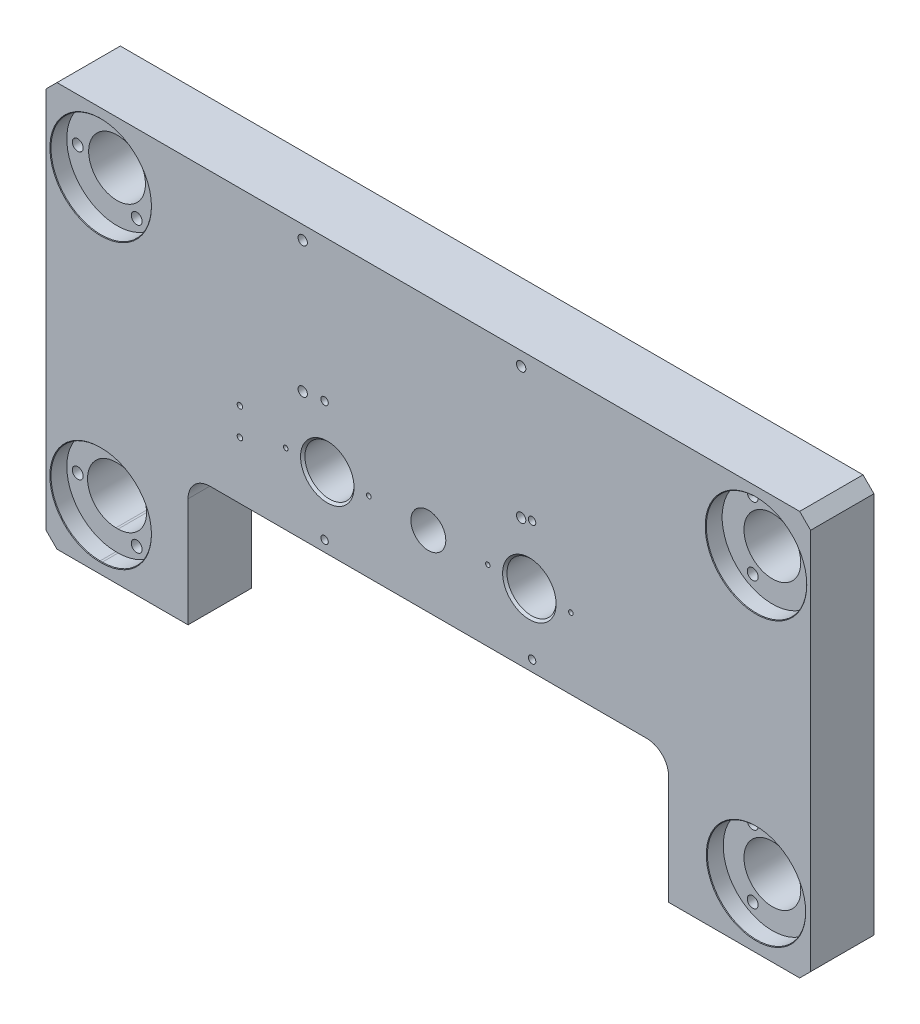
ISO-10303-21;
HEADER;
FILE_DESCRIPTION(('STEP AP214'),'2;1');
FILE_NAME('part.step','',(''),(''),'','','');
FILE_SCHEMA(('AUTOMOTIVE_DESIGN { 1 0 10303 214 1 1 1 1 }'));
ENDSEC;
DATA;
#1=APPLICATION_CONTEXT('core data for automotive mechanical design processes');
#2=APPLICATION_PROTOCOL_DEFINITION('international standard','automotive_design',2000,#1);
#3=PRODUCT_CONTEXT('',#1,'mechanical');
#4=PRODUCT('Part','Part','',(#3));
#5=PRODUCT_RELATED_PRODUCT_CATEGORY('part','',(#4));
#6=PRODUCT_DEFINITION_FORMATION('','',#4);
#7=PRODUCT_DEFINITION_CONTEXT('part definition',#1,'design');
#8=PRODUCT_DEFINITION('design','',#6,#7);
#9=PRODUCT_DEFINITION_SHAPE('','',#8);
#10=(LENGTH_UNIT() NAMED_UNIT(*) SI_UNIT(.MILLI.,.METRE.));
#11=(NAMED_UNIT(*) PLANE_ANGLE_UNIT() SI_UNIT($,.RADIAN.));
#12=(NAMED_UNIT(*) SI_UNIT($,.STERADIAN.) SOLID_ANGLE_UNIT());
#13=UNCERTAINTY_MEASURE_WITH_UNIT(LENGTH_MEASURE(1.E-05),#10,'distance_accuracy_value','');
#14=(GEOMETRIC_REPRESENTATION_CONTEXT(3) GLOBAL_UNCERTAINTY_ASSIGNED_CONTEXT((#13)) GLOBAL_UNIT_ASSIGNED_CONTEXT((#10,
#11,#12)) REPRESENTATION_CONTEXT('',''));
#15=CARTESIAN_POINT('',(0.,0.,0.));
#16=DIRECTION('',(0.,0.,1.));
#17=DIRECTION('',(1.,0.,0.));
#18=AXIS2_PLACEMENT_3D('',#15,#16,#17);
#19=CARTESIAN_POINT('',(-350.,-185.,58.));
#20=DIRECTION('',(0.,1.,0.));
#21=DIRECTION('',(0.,0.,1.));
#22=AXIS2_PLACEMENT_3D('',#19,#20,#21);
#23=PLANE('',#22);
#24=DIRECTION('',(1.,0.,0.));
#25=VECTOR('',#24,1.);
#26=CARTESIAN_POINT('',(-350.,-185.,0.));
#27=LINE('',#26,#25);
#28=CARTESIAN_POINT('',(-340.,-185.,1.66533453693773E-12));
#29=VERTEX_POINT('',#28);
#30=CARTESIAN_POINT('',(-220.,-185.,0.));
#31=VERTEX_POINT('',#30);
#32=EDGE_CURVE('E488',#29,#31,#27,.T.);
#33=ORIENTED_EDGE('',*,*,#32,.T.);
#34=DIRECTION('',(0.,0.,1.));
#35=VECTOR('',#34,1.);
#36=CARTESIAN_POINT('',(-220.,-185.,0.));
#37=LINE('',#36,#35);
#38=CARTESIAN_POINT('',(-220.,-185.,58.));
#39=VERTEX_POINT('',#38);
#40=EDGE_CURVE('E282',#31,#39,#37,.T.);
#41=ORIENTED_EDGE('',*,*,#40,.T.);
#42=DIRECTION('',(1.,0.,0.));
#43=VECTOR('',#42,1.);
#44=CARTESIAN_POINT('',(-350.,-185.,58.));
#45=LINE('',#44,#43);
#46=CARTESIAN_POINT('',(-340.,-185.,58.0000000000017));
#47=VERTEX_POINT('',#46);
#48=EDGE_CURVE('E475',#47,#39,#45,.T.);
#49=ORIENTED_EDGE('',*,*,#48,.F.);
#50=DIRECTION('',(0.,0.,-1.));
#51=VECTOR('',#50,1.);
#52=CARTESIAN_POINT('',(-340.,-185.,58.0000000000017));
#53=LINE('',#52,#51);
#54=EDGE_CURVE('E530',#47,#29,#53,.T.);
#55=ORIENTED_EDGE('',*,*,#54,.T.);
#56=EDGE_LOOP('',(#33,#41,#49,#55));
#57=FACE_BOUND('',#56,.T.);
#58=ADVANCED_FACE('F40',(#57),#23,.F.);
#59=CARTESIAN_POINT('',(-350.,-185.,0.));
#60=DIRECTION('',(0.,0.,1.));
#61=DIRECTION('',(1.,0.,0.));
#62=AXIS2_PLACEMENT_3D('',#59,#60,#61);
#63=PLANE('',#62);
#64=CARTESIAN_POINT('',(-172.5,-12.5,0.));
#65=DIRECTION('',(0.,0.,1.));
#66=DIRECTION('',(1.,0.,0.));
#67=AXIS2_PLACEMENT_3D('',#64,#65,#66);
#68=CIRCLE('',#67,2.49999999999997);
#69=CARTESIAN_POINT('',(-170.,-12.5,0.));
#70=VERTEX_POINT('',#69);
#71=EDGE_CURVE('E1335',#70,#70,#68,.T.);
#72=ORIENTED_EDGE('',*,*,#71,.T.);
#73=EDGE_LOOP('',(#72));
#74=FACE_BOUND('',#73,.T.);
#75=CARTESIAN_POINT('',(-172.499999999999,12.5,0.));
#76=DIRECTION('',(0.,0.,1.));
#77=DIRECTION('',(1.,0.,0.));
#78=AXIS2_PLACEMENT_3D('',#75,#76,#77);
#79=CIRCLE('',#78,2.49999999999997);
#80=CARTESIAN_POINT('',(-169.999999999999,12.5,0.));
#81=VERTEX_POINT('',#80);
#82=EDGE_CURVE('E1345',#81,#81,#79,.T.);
#83=ORIENTED_EDGE('',*,*,#82,.T.);
#84=EDGE_LOOP('',(#83));
#85=FACE_BOUND('',#84,.T.);
#86=CARTESIAN_POINT('',(-95.,55.,0.));
#87=DIRECTION('',(0.,0.,1.));
#88=DIRECTION('',(1.,0.,0.));
#89=AXIS2_PLACEMENT_3D('',#86,#87,#88);
#90=CIRCLE('',#89,3.39999999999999);
#91=CARTESIAN_POINT('',(-91.6,55.,0.));
#92=VERTEX_POINT('',#91);
#93=EDGE_CURVE('E1351',#92,#92,#90,.T.);
#94=ORIENTED_EDGE('',*,*,#93,.T.);
#95=EDGE_LOOP('',(#94));
#96=FACE_BOUND('',#95,.T.);
#97=CARTESIAN_POINT('',(95.,54.9999999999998,0.));
#98=DIRECTION('',(0.,0.,1.));
#99=DIRECTION('',(1.,0.,0.));
#100=AXIS2_PLACEMENT_3D('',#97,#98,#99);
#101=CIRCLE('',#100,3.39999999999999);
#102=CARTESIAN_POINT('',(98.4,54.9999999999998,0.));
#103=VERTEX_POINT('',#102);
#104=EDGE_CURVE('E1357',#103,#103,#101,.T.);
#105=ORIENTED_EDGE('',*,*,#104,.T.);
#106=EDGE_LOOP('',(#105));
#107=FACE_BOUND('',#106,.T.);
#108=CARTESIAN_POINT('',(95.,-55.,0.));
#109=DIRECTION('',(0.,0.,1.));
#110=DIRECTION('',(1.,0.,0.));
#111=AXIS2_PLACEMENT_3D('',#108,#109,#110);
#112=CIRCLE('',#111,3.39999999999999);
#113=CARTESIAN_POINT('',(98.4,-55.,0.));
#114=VERTEX_POINT('',#113);
#115=EDGE_CURVE('E1363',#114,#114,#112,.T.);
#116=ORIENTED_EDGE('',*,*,#115,.T.);
#117=EDGE_LOOP('',(#116));
#118=FACE_BOUND('',#117,.T.);
#119=CARTESIAN_POINT('',(-95.,-55.,0.));
#120=DIRECTION('',(0.,0.,1.));
#121=DIRECTION('',(1.,0.,0.));
#122=AXIS2_PLACEMENT_3D('',#119,#120,#121);
#123=CIRCLE('',#122,3.39999999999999);
#124=CARTESIAN_POINT('',(-91.6,-55.,0.));
#125=VERTEX_POINT('',#124);
#126=EDGE_CURVE('E1369',#125,#125,#123,.T.);
#127=ORIENTED_EDGE('',*,*,#126,.T.);
#128=EDGE_LOOP('',(#127));
#129=FACE_BOUND('',#128,.T.);
#130=CARTESIAN_POINT('',(0.,0.,0.));
#131=DIRECTION('',(0.,0.,1.));
#132=DIRECTION('',(1.,0.,0.));
#133=AXIS2_PLACEMENT_3D('',#130,#131,#132);
#134=CIRCLE('',#133,16.);
#135=CARTESIAN_POINT('',(16.,0.,0.));
#136=VERTEX_POINT('',#135);
#137=EDGE_CURVE('E248',#136,#136,#134,.T.);
#138=ORIENTED_EDGE('',*,*,#137,.T.);
#139=EDGE_LOOP('',(#138));
#140=FACE_BOUND('',#139,.T.);
#141=CARTESIAN_POINT('',(-188.,0.,0.));
#142=DIRECTION('',(0.,0.,-1.));
#143=DIRECTION('',(-1.,0.,0.));
#144=AXIS2_PLACEMENT_3D('',#141,#142,#143);
#145=CIRCLE('',#144,2.99999999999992);
#146=CARTESIAN_POINT('',(-191.,0.,0.));
#147=VERTEX_POINT('',#146);
#148=EDGE_CURVE('E314',#147,#147,#145,.T.);
#149=ORIENTED_EDGE('',*,*,#148,.F.);
#150=EDGE_LOOP('',(#149));
#151=FACE_BOUND('',#150,.T.);
#152=CARTESIAN_POINT('',(-92.5,0.,-1.66533453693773E-12));
#153=DIRECTION('',(0.,0.,1.));
#154=DIRECTION('',(1.,0.,0.));
#155=AXIS2_PLACEMENT_3D('',#152,#153,#154);
#156=CIRCLE('',#155,22.5);
#157=CARTESIAN_POINT('',(-70.,0.,-1.66533453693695E-12));
#158=VERTEX_POINT('',#157);
#159=EDGE_CURVE('E341',#158,#158,#156,.T.);
#160=ORIENTED_EDGE('',*,*,#159,.T.);
#161=EDGE_LOOP('',(#160));
#162=FACE_BOUND('',#161,.T.);
#163=CARTESIAN_POINT('',(92.5,0.,0.));
#164=DIRECTION('',(0.,0.,1.));
#165=DIRECTION('',(1.,0.,0.));
#166=AXIS2_PLACEMENT_3D('',#163,#164,#165);
#167=CIRCLE('',#166,22.5);
#168=CARTESIAN_POINT('',(115.,0.,0.));
#169=VERTEX_POINT('',#168);
#170=EDGE_CURVE('E344',#169,#169,#167,.T.);
#171=ORIENTED_EDGE('',*,*,#170,.T.);
#172=EDGE_LOOP('',(#171));
#173=FACE_BOUND('',#172,.T.);
#174=CARTESIAN_POINT('',(335.999999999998,-130.,0.));
#175=DIRECTION('',(0.,0.,1.));
#176=DIRECTION('',(-1.,0.,0.));
#177=AXIS2_PLACEMENT_3D('',#174,#175,#176);
#178=CIRCLE('',#177,5.);
#179=CARTESIAN_POINT('',(330.999999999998,-130.,0.));
#180=VERTEX_POINT('',#179);
#181=EDGE_CURVE('E347',#180,#180,#178,.T.);
#182=ORIENTED_EDGE('',*,*,#181,.T.);
#183=EDGE_LOOP('',(#182));
#184=FACE_BOUND('',#183,.T.);
#185=CARTESIAN_POINT('',(281.999999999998,-98.8230854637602,-1.66533453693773E-12));
#186=DIRECTION('',(0.,0.,1.));
#187=DIRECTION('',(-1.,0.,0.));
#188=AXIS2_PLACEMENT_3D('',#185,#186,#187);
#189=CIRCLE('',#188,5.);
#190=CARTESIAN_POINT('',(276.999999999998,-98.8230854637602,-1.66533453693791E-12));
#191=VERTEX_POINT('',#190);
#192=EDGE_CURVE('E351',#191,#191,#189,.T.);
#193=ORIENTED_EDGE('',*,*,#192,.T.);
#194=EDGE_LOOP('',(#193));
#195=FACE_BOUND('',#194,.T.);
#196=CARTESIAN_POINT('',(281.999999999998,-161.17691453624,-1.66533453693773E-12));
#197=DIRECTION('',(0.,0.,1.));
#198=DIRECTION('',(-1.,0.,0.));
#199=AXIS2_PLACEMENT_3D('',#196,#197,#198);
#200=CIRCLE('',#199,5.);
#201=CARTESIAN_POINT('',(276.999999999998,-161.17691453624,-1.66533453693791E-12));
#202=VERTEX_POINT('',#201);
#203=EDGE_CURVE('E355',#202,#202,#200,.T.);
#204=ORIENTED_EDGE('',*,*,#203,.T.);
#205=EDGE_LOOP('',(#204));
#206=FACE_BOUND('',#205,.T.);
#207=CARTESIAN_POINT('',(281.999999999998,98.8230854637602,0.));
#208=DIRECTION('',(0.,0.,-1.));
#209=DIRECTION('',(-1.,0.,0.));
#210=AXIS2_PLACEMENT_3D('',#207,#208,#209);
#211=CIRCLE('',#210,5.);
#212=CARTESIAN_POINT('',(276.999999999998,98.8230854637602,0.));
#213=VERTEX_POINT('',#212);
#214=EDGE_CURVE('E363',#213,#213,#211,.T.);
#215=ORIENTED_EDGE('',*,*,#214,.F.);
#216=EDGE_LOOP('',(#215));
#217=FACE_BOUND('',#216,.T.);
#218=CARTESIAN_POINT('',(-336.000000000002,-130.,0.));
#219=DIRECTION('',(0.,0.,-1.));
#220=DIRECTION('',(1.,0.,0.));
#221=AXIS2_PLACEMENT_3D('',#218,#219,#220);
#222=CIRCLE('',#221,5.);
#223=CARTESIAN_POINT('',(-331.000000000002,-130.,0.));
#224=VERTEX_POINT('',#223);
#225=EDGE_CURVE('E371',#224,#224,#222,.T.);
#226=ORIENTED_EDGE('',*,*,#225,.F.);
#227=EDGE_LOOP('',(#226));
#228=FACE_BOUND('',#227,.T.);
#229=CARTESIAN_POINT('',(-282.000000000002,-161.17691453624,0.));
#230=DIRECTION('',(0.,0.,-1.));
#231=DIRECTION('',(1.,0.,0.));
#232=AXIS2_PLACEMENT_3D('',#229,#230,#231);
#233=CIRCLE('',#232,5.);
#234=CARTESIAN_POINT('',(-277.000000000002,-161.17691453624,0.));
#235=VERTEX_POINT('',#234);
#236=EDGE_CURVE('E379',#235,#235,#233,.T.);
#237=ORIENTED_EDGE('',*,*,#236,.F.);
#238=EDGE_LOOP('',(#237));
#239=FACE_BOUND('',#238,.T.);
#240=CARTESIAN_POINT('',(-336.,130.,0.));
#241=DIRECTION('',(0.,0.,1.));
#242=DIRECTION('',(1.,0.,0.));
#243=AXIS2_PLACEMENT_3D('',#240,#241,#242);
#244=CIRCLE('',#243,5.);
#245=CARTESIAN_POINT('',(-331.,130.,0.));
#246=VERTEX_POINT('',#245);
#247=EDGE_CURVE('E383',#246,#246,#244,.T.);
#248=ORIENTED_EDGE('',*,*,#247,.T.);
#249=EDGE_LOOP('',(#248));
#250=FACE_BOUND('',#249,.T.);
#251=CARTESIAN_POINT('',(-282.000000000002,98.8230854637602,1.66533453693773E-12));
#252=DIRECTION('',(0.,0.,1.));
#253=DIRECTION('',(1.,0.,0.));
#254=AXIS2_PLACEMENT_3D('',#251,#252,#253);
#255=CIRCLE('',#254,5.);
#256=CARTESIAN_POINT('',(-277.000000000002,98.8230854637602,1.66533453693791E-12));
#257=VERTEX_POINT('',#256);
#258=EDGE_CURVE('E387',#257,#257,#255,.T.);
#259=ORIENTED_EDGE('',*,*,#258,.T.);
#260=EDGE_LOOP('',(#259));
#261=FACE_BOUND('',#260,.T.);
#262=CARTESIAN_POINT('',(-282.000000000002,161.17691453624,1.66533453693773E-12));
#263=DIRECTION('',(0.,0.,1.));
#264=DIRECTION('',(1.,0.,0.));
#265=AXIS2_PLACEMENT_3D('',#262,#263,#264);
#266=CIRCLE('',#265,5.);
#267=CARTESIAN_POINT('',(-277.000000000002,161.17691453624,1.66533453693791E-12));
#268=VERTEX_POINT('',#267);
#269=EDGE_CURVE('E391',#268,#268,#266,.T.);
#270=ORIENTED_EDGE('',*,*,#269,.T.);
#271=EDGE_LOOP('',(#270));
#272=FACE_BOUND('',#271,.T.);
#273=DIRECTION('',(1.,0.,0.));
#274=VECTOR('',#273,1.);
#275=CARTESIAN_POINT('',(-301.000000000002,-156.,-1.66533453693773E-12));
#276=LINE('',#275,#274);
#277=CARTESIAN_POINT('',(-301.000000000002,-156.,-1.66533453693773E-12));
#278=VERTEX_POINT('',#277);
#279=CARTESIAN_POINT('',(-299.000000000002,-156.,0.));
#280=VERTEX_POINT('',#279);
#281=EDGE_CURVE('E445',#278,#280,#276,.T.);
#282=ORIENTED_EDGE('',*,*,#281,.T.);
#283=CARTESIAN_POINT('',(-299.000000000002,-130.,0.));
#284=DIRECTION('',(0.,0.,1.));
#285=DIRECTION('',(1.,0.,0.));
#286=AXIS2_PLACEMENT_3D('',#283,#284,#285);
#287=CIRCLE('',#286,26.);
#288=CARTESIAN_POINT('',(-299.000000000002,-104.,0.));
#289=VERTEX_POINT('',#288);
#290=EDGE_CURVE('E436',#280,#289,#287,.T.);
#291=ORIENTED_EDGE('',*,*,#290,.T.);
#292=DIRECTION('',(-1.,0.,0.));
#293=VECTOR('',#292,1.);
#294=CARTESIAN_POINT('',(-301.000000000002,-104.,-1.66533453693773E-12));
#295=LINE('',#294,#293);
#296=CARTESIAN_POINT('',(-301.000000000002,-104.,-1.66533453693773E-12));
#297=VERTEX_POINT('',#296);
#298=EDGE_CURVE('E439',#289,#297,#295,.T.);
#299=ORIENTED_EDGE('',*,*,#298,.T.);
#300=CARTESIAN_POINT('',(-301.000000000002,-130.,-1.66533453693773E-12));
#301=DIRECTION('',(0.,0.,1.));
#302=DIRECTION('',(1.,0.,0.));
#303=AXIS2_PLACEMENT_3D('',#300,#301,#302);
#304=CIRCLE('',#303,26.);
#305=EDGE_CURVE('E442',#297,#278,#304,.T.);
#306=ORIENTED_EDGE('',*,*,#305,.T.);
#307=EDGE_LOOP('',(#282,#291,#299,#306));
#308=FACE_BOUND('',#307,.T.);
#309=CARTESIAN_POINT('',(-300.,130.,0.));
#310=DIRECTION('',(0.,0.,1.));
#311=DIRECTION('',(1.,0.,0.));
#312=AXIS2_PLACEMENT_3D('',#309,#310,#311);
#313=CIRCLE('',#312,26.);
#314=CARTESIAN_POINT('',(-274.,130.,0.));
#315=VERTEX_POINT('',#314);
#316=EDGE_CURVE('E452',#315,#315,#313,.T.);
#317=ORIENTED_EDGE('',*,*,#316,.T.);
#318=EDGE_LOOP('',(#317));
#319=FACE_BOUND('',#318,.T.);
#320=CARTESIAN_POINT('',(299.999999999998,-130.,0.));
#321=DIRECTION('',(0.,0.,1.));
#322=DIRECTION('',(1.,0.,0.));
#323=AXIS2_PLACEMENT_3D('',#320,#321,#322);
#324=CIRCLE('',#323,26.);
#325=CARTESIAN_POINT('',(325.999999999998,-130.,0.));
#326=VERTEX_POINT('',#325);
#327=EDGE_CURVE('E463',#326,#326,#324,.T.);
#328=ORIENTED_EDGE('',*,*,#327,.T.);
#329=EDGE_LOOP('',(#328));
#330=FACE_BOUND('',#329,.T.);
#331=CARTESIAN_POINT('',(300.,130.,0.));
#332=DIRECTION('',(0.,0.,1.));
#333=DIRECTION('',(1.,0.,0.));
#334=AXIS2_PLACEMENT_3D('',#331,#332,#333);
#335=CIRCLE('',#334,26.);
#336=CARTESIAN_POINT('',(326.,130.,0.));
#337=VERTEX_POINT('',#336);
#338=EDGE_CURVE('E466',#337,#337,#335,.T.);
#339=ORIENTED_EDGE('',*,*,#338,.T.);
#340=EDGE_LOOP('',(#339));
#341=FACE_BOUND('',#340,.T.);
#342=DIRECTION('',(-1.,0.,0.));
#343=VECTOR('',#342,1.);
#344=CARTESIAN_POINT('',(-200.,-65.,0.));
#345=LINE('',#344,#343);
#346=CARTESIAN_POINT('',(200.,-65.,0.));
#347=VERTEX_POINT('',#346);
#348=CARTESIAN_POINT('',(-200.,-65.,0.));
#349=VERTEX_POINT('',#348);
#350=EDGE_CURVE('E277',#347,#349,#345,.T.);
#351=ORIENTED_EDGE('',*,*,#350,.T.);
#352=CARTESIAN_POINT('',(-200.,-85.,0.));
#353=DIRECTION('',(0.,0.,1.));
#354=DIRECTION('',(-1.,0.,0.));
#355=AXIS2_PLACEMENT_3D('',#352,#353,#354);
#356=CIRCLE('',#355,20.);
#357=CARTESIAN_POINT('',(-220.,-85.,-1.66533453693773E-12));
#358=VERTEX_POINT('',#357);
#359=EDGE_CURVE('E279',#349,#358,#356,.T.);
#360=ORIENTED_EDGE('',*,*,#359,.T.);
#361=DIRECTION('',(0.,-1.,0.));
#362=VECTOR('',#361,1.);
#363=CARTESIAN_POINT('',(-220.,-185.,0.));
#364=LINE('',#363,#362);
#365=EDGE_CURVE('E267',#358,#31,#364,.T.);
#366=ORIENTED_EDGE('',*,*,#365,.T.);
#367=ORIENTED_EDGE('',*,*,#32,.F.);
#368=DIRECTION('',(0.707106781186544,-0.707106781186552,0.));
#369=VECTOR('',#368,1.);
#370=CARTESIAN_POINT('',(-340.,-185.,1.66533453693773E-12));
#371=LINE('',#370,#369);
#372=CARTESIAN_POINT('',(-350.000000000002,-175.,0.));
#373=VERTEX_POINT('',#372);
#374=EDGE_CURVE('E503',#29,#373,#371,.F.);
#375=ORIENTED_EDGE('',*,*,#374,.T.);
#376=DIRECTION('',(0.,-1.,0.));
#377=VECTOR('',#376,1.);
#378=CARTESIAN_POINT('',(-350.000000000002,185.,0.));
#379=LINE('',#378,#377);
#380=CARTESIAN_POINT('',(-350.,175.,0.));
#381=VERTEX_POINT('',#380);
#382=EDGE_CURVE('E469',#381,#373,#379,.T.);
#383=ORIENTED_EDGE('',*,*,#382,.F.);
#384=DIRECTION('',(-0.70710678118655,-0.707106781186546,0.));
#385=VECTOR('',#384,1.);
#386=CARTESIAN_POINT('',(-350.,175.,0.));
#387=LINE('',#386,#385);
#388=CARTESIAN_POINT('',(-340.000000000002,185.,1.66533453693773E-12));
#389=VERTEX_POINT('',#388);
#390=EDGE_CURVE('E507',#381,#389,#387,.F.);
#391=ORIENTED_EDGE('',*,*,#390,.T.);
#392=DIRECTION('',(-1.,0.,0.));
#393=VECTOR('',#392,1.);
#394=CARTESIAN_POINT('',(-350.000000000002,185.,0.));
#395=LINE('',#394,#393);
#396=CARTESIAN_POINT('',(339.999999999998,185.,0.));
#397=VERTEX_POINT('',#396);
#398=EDGE_CURVE('E474',#397,#389,#395,.T.);
#399=ORIENTED_EDGE('',*,*,#398,.F.);
#400=DIRECTION('',(-0.70710678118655,0.707106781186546,0.));
#401=VECTOR('',#400,1.);
#402=CARTESIAN_POINT('',(339.999999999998,185.,0.));
#403=LINE('',#402,#401);
#404=CARTESIAN_POINT('',(350.,175.,1.66533453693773E-12));
#405=VERTEX_POINT('',#404);
#406=EDGE_CURVE('E505',#397,#405,#403,.F.);
#407=ORIENTED_EDGE('',*,*,#406,.T.);
#408=DIRECTION('',(0.,1.,0.));
#409=VECTOR('',#408,1.);
#410=CARTESIAN_POINT('',(349.999999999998,185.,1.66533453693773E-12));
#411=LINE('',#410,#409);
#412=CARTESIAN_POINT('',(349.999999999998,-175.,1.66533453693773E-12));
#413=VERTEX_POINT('',#412);
#414=EDGE_CURVE('E491',#413,#405,#411,.T.);
#415=ORIENTED_EDGE('',*,*,#414,.F.);
#416=DIRECTION('',(0.70710678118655,0.707106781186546,0.));
#417=VECTOR('',#416,1.);
#418=CARTESIAN_POINT('',(349.999999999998,-175.,1.66533453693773E-12));
#419=LINE('',#418,#417);
#420=CARTESIAN_POINT('',(340.,-185.,0.));
#421=VERTEX_POINT('',#420);
#422=EDGE_CURVE('E500',#413,#421,#419,.F.);
#423=ORIENTED_EDGE('',*,*,#422,.T.);
#424=CARTESIAN_POINT('',(220.,-185.,0.));
#425=VERTEX_POINT('',#424);
#426=EDGE_CURVE('E487',#425,#421,#27,.T.);
#427=ORIENTED_EDGE('',*,*,#426,.F.);
#428=DIRECTION('',(0.,1.,0.));
#429=VECTOR('',#428,1.);
#430=CARTESIAN_POINT('',(220.,-185.,0.));
#431=LINE('',#430,#429);
#432=CARTESIAN_POINT('',(220.,-85.,-1.66533453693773E-12));
#433=VERTEX_POINT('',#432);
#434=EDGE_CURVE('E270',#425,#433,#431,.T.);
#435=ORIENTED_EDGE('',*,*,#434,.T.);
#436=CARTESIAN_POINT('',(200.,-85.,0.));
#437=DIRECTION('',(0.,0.,1.));
#438=DIRECTION('',(-1.,0.,0.));
#439=AXIS2_PLACEMENT_3D('',#436,#437,#438);
#440=CIRCLE('',#439,20.);
#441=EDGE_CURVE('E274',#433,#347,#440,.T.);
#442=ORIENTED_EDGE('',*,*,#441,.T.);
#443=EDGE_LOOP('',(#351,#360,#366,#367,#375,#383,#391,#399,#407,#415,#423,#427,#435,#442));
#444=FACE_BOUND('',#443,.T.);
#445=CARTESIAN_POINT('',(-282.000000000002,-98.8230854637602,0.));
#446=DIRECTION('',(0.,0.,-1.));
#447=DIRECTION('',(1.,0.,0.));
#448=AXIS2_PLACEMENT_3D('',#445,#446,#447);
#449=CIRCLE('',#448,5.);
#450=CARTESIAN_POINT('',(-277.000000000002,-98.8230854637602,0.));
#451=VERTEX_POINT('',#450);
#452=EDGE_CURVE('E375',#451,#451,#449,.T.);
#453=ORIENTED_EDGE('',*,*,#452,.F.);
#454=EDGE_LOOP('',(#453));
#455=FACE_BOUND('',#454,.T.);
#456=CARTESIAN_POINT('',(281.999999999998,161.17691453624,0.));
#457=DIRECTION('',(0.,0.,-1.));
#458=DIRECTION('',(-1.,0.,0.));
#459=AXIS2_PLACEMENT_3D('',#456,#457,#458);
#460=CIRCLE('',#459,5.);
#461=CARTESIAN_POINT('',(276.999999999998,161.17691453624,0.));
#462=VERTEX_POINT('',#461);
#463=EDGE_CURVE('E367',#462,#462,#460,.T.);
#464=ORIENTED_EDGE('',*,*,#463,.F.);
#465=EDGE_LOOP('',(#464));
#466=FACE_BOUND('',#465,.T.);
#467=CARTESIAN_POINT('',(336.,130.,0.));
#468=DIRECTION('',(0.,0.,-1.));
#469=DIRECTION('',(-1.,0.,0.));
#470=AXIS2_PLACEMENT_3D('',#467,#468,#469);
#471=CIRCLE('',#470,5.);
#472=CARTESIAN_POINT('',(331.,130.,0.));
#473=VERTEX_POINT('',#472);
#474=EDGE_CURVE('E359',#473,#473,#471,.T.);
#475=ORIENTED_EDGE('',*,*,#474,.F.);
#476=EDGE_LOOP('',(#475));
#477=FACE_BOUND('',#476,.T.);
#478=CARTESIAN_POINT('',(188.,0.,0.));
#479=DIRECTION('',(0.,0.,-1.));
#480=DIRECTION('',(-1.,0.,0.));
#481=AXIS2_PLACEMENT_3D('',#478,#479,#480);
#482=CIRCLE('',#481,2.99999999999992);
#483=CARTESIAN_POINT('',(185.,0.,0.));
#484=VERTEX_POINT('',#483);
#485=EDGE_CURVE('E308',#484,#484,#482,.T.);
#486=ORIENTED_EDGE('',*,*,#485,.F.);
#487=EDGE_LOOP('',(#486));
#488=FACE_BOUND('',#487,.T.);
#489=ADVANCED_FACE('F635',(#74,#85,#96,#107,#118,#129,#140,#151,#162,#173,#184,#195,#206,#217,
#228,#239,#250,#261,#272,#308,#319,#330,#341,#444,#455,#466,#477,#488),#63,.F.);
#490=CARTESIAN_POINT('',(300.,130.,43.));
#491=DIRECTION('',(0.,0.,1.));
#492=DIRECTION('',(1.,0.,0.));
#493=AXIS2_PLACEMENT_3D('',#490,#491,#492);
#494=PLANE('',#493);
#495=CARTESIAN_POINT('',(281.999999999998,98.8230854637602,43.));
#496=DIRECTION('',(0.,0.,1.));
#497=DIRECTION('',(1.,0.,0.));
#498=AXIS2_PLACEMENT_3D('',#495,#496,#497);
#499=CIRCLE('',#498,5.);
#500=CARTESIAN_POINT('',(286.999999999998,98.8230854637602,43.));
#501=VERTEX_POINT('',#500);
#502=EDGE_CURVE('E366',#501,#501,#499,.F.);
#503=ORIENTED_EDGE('',*,*,#502,.T.);
#504=EDGE_LOOP('',(#503));
#505=FACE_BOUND('',#504,.T.);
#506=CARTESIAN_POINT('',(300.,130.,43.));
#507=DIRECTION('',(0.,0.,1.));
#508=DIRECTION('',(1.,0.,0.));
#509=AXIS2_PLACEMENT_3D('',#506,#507,#508);
#510=CIRCLE('',#509,26.);
#511=CARTESIAN_POINT('',(326.,130.,43.));
#512=VERTEX_POINT('',#511);
#513=EDGE_CURVE('E435',#512,#512,#510,.F.);
#514=ORIENTED_EDGE('',*,*,#513,.T.);
#515=EDGE_LOOP('',(#514));
#516=FACE_BOUND('',#515,.T.);
#517=CARTESIAN_POINT('',(300.,130.,43.));
#518=DIRECTION('',(0.,0.,1.));
#519=DIRECTION('',(1.,0.,0.));
#520=AXIS2_PLACEMENT_3D('',#517,#518,#519);
#521=CIRCLE('',#520,46.);
#522=CARTESIAN_POINT('',(346.,130.,43.));
#523=VERTEX_POINT('',#522);
#524=EDGE_CURVE('E432',#523,#523,#521,.T.);
#525=ORIENTED_EDGE('',*,*,#524,.T.);
#526=EDGE_LOOP('',(#525));
#527=FACE_BOUND('',#526,.T.);
#528=CARTESIAN_POINT('',(282.,161.17691453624,43.));
#529=DIRECTION('',(0.,0.,1.));
#530=DIRECTION('',(1.,0.,0.));
#531=AXIS2_PLACEMENT_3D('',#528,#529,#530);
#532=CIRCLE('',#531,5.);
#533=CARTESIAN_POINT('',(287.,161.17691453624,43.));
#534=VERTEX_POINT('',#533);
#535=EDGE_CURVE('E370',#534,#534,#532,.F.);
#536=ORIENTED_EDGE('',*,*,#535,.T.);
#537=EDGE_LOOP('',(#536));
#538=FACE_BOUND('',#537,.T.);
#539=CARTESIAN_POINT('',(336.,130.,43.));
#540=DIRECTION('',(0.,0.,1.));
#541=DIRECTION('',(1.,0.,0.));
#542=AXIS2_PLACEMENT_3D('',#539,#540,#541);
#543=CIRCLE('',#542,5.);
#544=CARTESIAN_POINT('',(341.,130.,43.));
#545=VERTEX_POINT('',#544);
#546=EDGE_CURVE('E362',#545,#545,#543,.F.);
#547=ORIENTED_EDGE('',*,*,#546,.T.);
#548=EDGE_LOOP('',(#547));
#549=FACE_BOUND('',#548,.T.);
#550=ADVANCED_FACE('F642',(#505,#516,#527,#538,#549),#494,.T.);
#551=CARTESIAN_POINT('',(-301.,-130.,42.9999999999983));
#552=DIRECTION('',(0.,0.,1.));
#553=DIRECTION('',(1.,0.,0.));
#554=AXIS2_PLACEMENT_3D('',#551,#552,#553);
#555=PLANE('',#554);
#556=CARTESIAN_POINT('',(-282.,-98.8230854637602,43.));
#557=DIRECTION('',(0.,0.,1.));
#558=DIRECTION('',(1.,0.,0.));
#559=AXIS2_PLACEMENT_3D('',#556,#557,#558);
#560=CIRCLE('',#559,5.);
#561=CARTESIAN_POINT('',(-277.,-98.8230854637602,43.));
#562=VERTEX_POINT('',#561);
#563=EDGE_CURVE('E378',#562,#562,#560,.F.);
#564=ORIENTED_EDGE('',*,*,#563,.T.);
#565=EDGE_LOOP('',(#564));
#566=FACE_BOUND('',#565,.T.);
#567=CARTESIAN_POINT('',(-299.,-130.,43.));
#568=DIRECTION('',(0.,0.,1.));
#569=DIRECTION('',(1.,0.,0.));
#570=AXIS2_PLACEMENT_3D('',#567,#568,#569);
#571=CIRCLE('',#570,26.);
#572=CARTESIAN_POINT('',(-299.,-104.,43.));
#573=VERTEX_POINT('',#572);
#574=CARTESIAN_POINT('',(-299.000000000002,-156.,43.));
#575=VERTEX_POINT('',#574);
#576=EDGE_CURVE('E422',#573,#575,#571,.F.);
#577=ORIENTED_EDGE('',*,*,#576,.T.);
#578=DIRECTION('',(-1.,0.,0.));
#579=VECTOR('',#578,1.);
#580=CARTESIAN_POINT('',(-301.000000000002,-156.,42.9999999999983));
#581=LINE('',#580,#579);
#582=CARTESIAN_POINT('',(-301.000000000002,-156.,42.9999999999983));
#583=VERTEX_POINT('',#582);
#584=EDGE_CURVE('E420',#575,#583,#581,.T.);
#585=ORIENTED_EDGE('',*,*,#584,.T.);
#586=CARTESIAN_POINT('',(-301.,-130.,42.9999999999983));
#587=DIRECTION('',(0.,0.,1.));
#588=DIRECTION('',(1.,0.,0.));
#589=AXIS2_PLACEMENT_3D('',#586,#587,#588);
#590=CIRCLE('',#589,26.);
#591=CARTESIAN_POINT('',(-301.,-104.,42.9999999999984));
#592=VERTEX_POINT('',#591);
#593=EDGE_CURVE('E411',#583,#592,#590,.F.);
#594=ORIENTED_EDGE('',*,*,#593,.T.);
#595=DIRECTION('',(1.,0.,0.));
#596=VECTOR('',#595,1.);
#597=CARTESIAN_POINT('',(-301.,-104.,42.9999999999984));
#598=LINE('',#597,#596);
#599=EDGE_CURVE('E533',#592,#573,#598,.T.);
#600=ORIENTED_EDGE('',*,*,#599,.T.);
#601=EDGE_LOOP('',(#577,#585,#594,#600));
#602=FACE_BOUND('',#601,.T.);
#603=CARTESIAN_POINT('',(-301.,-130.,42.9999999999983));
#604=DIRECTION('',(0.,0.,1.));
#605=DIRECTION('',(1.,0.,0.));
#606=AXIS2_PLACEMENT_3D('',#603,#604,#605);
#607=CIRCLE('',#606,45.);
#608=CARTESIAN_POINT('',(-301.,-85.,42.9999999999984));
#609=VERTEX_POINT('',#608);
#610=CARTESIAN_POINT('',(-301.,-175.,43.));
#611=VERTEX_POINT('',#610);
#612=EDGE_CURVE('E395',#609,#611,#607,.T.);
#613=ORIENTED_EDGE('',*,*,#612,.T.);
#614=DIRECTION('',(1.,0.,0.));
#615=VECTOR('',#614,1.);
#616=CARTESIAN_POINT('',(-301.,-175.,43.));
#617=LINE('',#616,#615);
#618=CARTESIAN_POINT('',(-299.,-175.,43.0000000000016));
#619=VERTEX_POINT('',#618);
#620=EDGE_CURVE('E398',#611,#619,#617,.T.);
#621=ORIENTED_EDGE('',*,*,#620,.T.);
#622=CARTESIAN_POINT('',(-299.,-130.,43.));
#623=DIRECTION('',(0.,0.,1.));
#624=DIRECTION('',(1.,0.,0.));
#625=AXIS2_PLACEMENT_3D('',#622,#623,#624);
#626=CIRCLE('',#625,45.);
#627=CARTESIAN_POINT('',(-299.,-85.,43.));
#628=VERTEX_POINT('',#627);
#629=EDGE_CURVE('E402',#619,#628,#626,.T.);
#630=ORIENTED_EDGE('',*,*,#629,.T.);
#631=DIRECTION('',(-1.,0.,0.));
#632=VECTOR('',#631,1.);
#633=CARTESIAN_POINT('',(-301.,-85.,42.9999999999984));
#634=LINE('',#633,#632);
#635=EDGE_CURVE('E405',#628,#609,#634,.T.);
#636=ORIENTED_EDGE('',*,*,#635,.T.);
#637=EDGE_LOOP('',(#613,#621,#630,#636));
#638=FACE_BOUND('',#637,.T.);
#639=CARTESIAN_POINT('',(-282.000000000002,-161.17691453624,43.));
#640=DIRECTION('',(0.,0.,1.));
#641=DIRECTION('',(1.,0.,0.));
#642=AXIS2_PLACEMENT_3D('',#639,#640,#641);
#643=CIRCLE('',#642,5.);
#644=CARTESIAN_POINT('',(-277.000000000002,-161.17691453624,43.));
#645=VERTEX_POINT('',#644);
#646=EDGE_CURVE('E382',#645,#645,#643,.F.);
#647=ORIENTED_EDGE('',*,*,#646,.T.);
#648=EDGE_LOOP('',(#647));
#649=FACE_BOUND('',#648,.T.);
#650=CARTESIAN_POINT('',(-336.,-130.,43.));
#651=DIRECTION('',(0.,0.,1.));
#652=DIRECTION('',(1.,0.,0.));
#653=AXIS2_PLACEMENT_3D('',#650,#651,#652);
#654=CIRCLE('',#653,5.);
#655=CARTESIAN_POINT('',(-331.,-130.,43.));
#656=VERTEX_POINT('',#655);
#657=EDGE_CURVE('E374',#656,#656,#654,.F.);
#658=ORIENTED_EDGE('',*,*,#657,.T.);
#659=EDGE_LOOP('',(#658));
#660=FACE_BOUND('',#659,.T.);
#661=ADVANCED_FACE('F825',(#566,#602,#638,#649,#660),#555,.T.);
#662=CARTESIAN_POINT('',(-299.000000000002,-130.,0.));
#663=DIRECTION('',(0.,0.,1.));
#664=DIRECTION('',(1.,0.,0.));
#665=AXIS2_PLACEMENT_3D('',#662,#663,#664);
#666=CYLINDRICAL_SURFACE('',#665,26.);
#667=ORIENTED_EDGE('',*,*,#576,.F.);
#668=DIRECTION('',(0.,0.,1.));
#669=VECTOR('',#668,1.);
#670=CARTESIAN_POINT('',(-299.000000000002,-104.,0.));
#671=LINE('',#670,#669);
#672=EDGE_CURVE('E448',#289,#573,#671,.T.);
#673=ORIENTED_EDGE('',*,*,#672,.F.);
#674=ORIENTED_EDGE('',*,*,#290,.F.);
#675=DIRECTION('',(0.,0.,1.));
#676=VECTOR('',#675,1.);
#677=CARTESIAN_POINT('',(-299.000000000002,-156.,0.));
#678=LINE('',#677,#676);
#679=EDGE_CURVE('E449',#280,#575,#678,.T.);
#680=ORIENTED_EDGE('',*,*,#679,.T.);
#681=EDGE_LOOP('',(#667,#673,#674,#680));
#682=FACE_BOUND('',#681,.T.);
#683=ADVANCED_FACE('F828',(#682),#666,.F.);
#684=CARTESIAN_POINT('',(-301.000000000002,-156.,-1.66533453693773E-12));
#685=DIRECTION('',(0.,-1.,0.));
#686=DIRECTION('',(0.,0.,-1.));
#687=AXIS2_PLACEMENT_3D('',#684,#685,#686);
#688=PLANE('',#687);
#689=ORIENTED_EDGE('',*,*,#584,.F.);
#690=ORIENTED_EDGE('',*,*,#679,.F.);
#691=ORIENTED_EDGE('',*,*,#281,.F.);
#692=DIRECTION('',(0.,0.,1.));
#693=VECTOR('',#692,1.);
#694=CARTESIAN_POINT('',(-301.000000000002,-156.,-1.66533453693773E-12));
#695=LINE('',#694,#693);
#696=EDGE_CURVE('E453',#278,#583,#695,.T.);
#697=ORIENTED_EDGE('',*,*,#696,.T.);
#698=EDGE_LOOP('',(#689,#690,#691,#697));
#699=FACE_BOUND('',#698,.T.);
#700=ADVANCED_FACE('F869',(#699),#688,.F.);
#701=CARTESIAN_POINT('',(-301.000000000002,-130.,-1.66533453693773E-12));
#702=DIRECTION('',(0.,0.,1.));
#703=DIRECTION('',(1.,0.,0.));
#704=AXIS2_PLACEMENT_3D('',#701,#702,#703);
#705=CYLINDRICAL_SURFACE('',#704,26.);
#706=ORIENTED_EDGE('',*,*,#593,.F.);
#707=ORIENTED_EDGE('',*,*,#696,.F.);
#708=ORIENTED_EDGE('',*,*,#305,.F.);
#709=DIRECTION('',(0.,0.,1.));
#710=VECTOR('',#709,1.);
#711=CARTESIAN_POINT('',(-301.000000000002,-104.,-1.66533453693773E-12));
#712=LINE('',#711,#710);
#713=EDGE_CURVE('E456',#297,#592,#712,.T.);
#714=ORIENTED_EDGE('',*,*,#713,.T.);
#715=EDGE_LOOP('',(#706,#707,#708,#714));
#716=FACE_BOUND('',#715,.T.);
#717=ADVANCED_FACE('F872',(#716),#705,.F.);
#718=CARTESIAN_POINT('',(-301.000000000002,-104.,-1.66533453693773E-12));
#719=DIRECTION('',(0.,1.,0.));
#720=DIRECTION('',(0.,0.,1.));
#721=AXIS2_PLACEMENT_3D('',#718,#719,#720);
#722=PLANE('',#721);
#723=ORIENTED_EDGE('',*,*,#599,.F.);
#724=ORIENTED_EDGE('',*,*,#713,.F.);
#725=ORIENTED_EDGE('',*,*,#298,.F.);
#726=ORIENTED_EDGE('',*,*,#672,.T.);
#727=EDGE_LOOP('',(#723,#724,#725,#726));
#728=FACE_BOUND('',#727,.T.);
#729=ADVANCED_FACE('F876',(#728),#722,.F.);
#730=CARTESIAN_POINT('',(-300.,130.,0.));
#731=DIRECTION('',(0.,0.,1.));
#732=DIRECTION('',(1.,0.,0.));
#733=AXIS2_PLACEMENT_3D('',#730,#731,#732);
#734=CYLINDRICAL_SURFACE('',#733,26.);
#735=ORIENTED_EDGE('',*,*,#316,.F.);
#736=EDGE_LOOP('',(#735));
#737=FACE_BOUND('',#736,.T.);
#738=CARTESIAN_POINT('',(-300.,130.000000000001,43.));
#739=DIRECTION('',(0.,0.,1.));
#740=DIRECTION('',(1.,0.,0.));
#741=AXIS2_PLACEMENT_3D('',#738,#739,#740);
#742=CIRCLE('',#741,26.);
#743=CARTESIAN_POINT('',(-274.,130.000000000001,43.));
#744=VERTEX_POINT('',#743);
#745=EDGE_CURVE('E427',#744,#744,#742,.F.);
#746=ORIENTED_EDGE('',*,*,#745,.F.);
#747=EDGE_LOOP('',(#746));
#748=FACE_BOUND('',#747,.T.);
#749=ADVANCED_FACE('F880',(#737,#748),#734,.F.);
#750=CARTESIAN_POINT('',(299.999999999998,-130.,0.));
#751=DIRECTION('',(0.,0.,1.));
#752=DIRECTION('',(1.,0.,0.));
#753=AXIS2_PLACEMENT_3D('',#750,#751,#752);
#754=CYLINDRICAL_SURFACE('',#753,26.);
#755=ORIENTED_EDGE('',*,*,#327,.F.);
#756=EDGE_LOOP('',(#755));
#757=FACE_BOUND('',#756,.T.);
#758=CARTESIAN_POINT('',(300.,-130.,43.));
#759=DIRECTION('',(0.,0.,1.));
#760=DIRECTION('',(1.,0.,0.));
#761=AXIS2_PLACEMENT_3D('',#758,#759,#760);
#762=CIRCLE('',#761,26.);
#763=CARTESIAN_POINT('',(326.,-130.,43.));
#764=VERTEX_POINT('',#763);
#765=EDGE_CURVE('E431',#764,#764,#762,.F.);
#766=ORIENTED_EDGE('',*,*,#765,.F.);
#767=EDGE_LOOP('',(#766));
#768=FACE_BOUND('',#767,.T.);
#769=ADVANCED_FACE('F887',(#757,#768),#754,.F.);
#770=CARTESIAN_POINT('',(300.,130.,0.));
#771=DIRECTION('',(0.,0.,1.));
#772=DIRECTION('',(1.,0.,0.));
#773=AXIS2_PLACEMENT_3D('',#770,#771,#772);
#774=CYLINDRICAL_SURFACE('',#773,26.);
#775=ORIENTED_EDGE('',*,*,#338,.F.);
#776=EDGE_LOOP('',(#775));
#777=FACE_BOUND('',#776,.T.);
#778=ORIENTED_EDGE('',*,*,#513,.F.);
#779=EDGE_LOOP('',(#778));
#780=FACE_BOUND('',#779,.T.);
#781=ADVANCED_FACE('F657',(#777,#780),#774,.F.);
#782=CARTESIAN_POINT('',(-350.,185.,58.));
#783=DIRECTION('',(1.,0.,0.));
#784=DIRECTION('',(0.,0.,-1.));
#785=AXIS2_PLACEMENT_3D('',#782,#783,#784);
#786=PLANE('',#785);
#787=DIRECTION('',(0.,-1.,0.));
#788=VECTOR('',#787,1.);
#789=CARTESIAN_POINT('',(-350.,185.,58.));
#790=LINE('',#789,#788);
#791=CARTESIAN_POINT('',(-349.999999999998,175.,58.));
#792=VERTEX_POINT('',#791);
#793=CARTESIAN_POINT('',(-350.,-175.,58.));
#794=VERTEX_POINT('',#793);
#795=EDGE_CURVE('E470',#792,#794,#790,.T.);
#796=ORIENTED_EDGE('',*,*,#795,.F.);
#797=DIRECTION('',(0.,0.,-1.));
#798=VECTOR('',#797,1.);
#799=CARTESIAN_POINT('',(-349.999999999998,175.,58.));
#800=LINE('',#799,#798);
#801=EDGE_CURVE('E497',#792,#381,#800,.T.);
#802=ORIENTED_EDGE('',*,*,#801,.T.);
#803=ORIENTED_EDGE('',*,*,#382,.T.);
#804=DIRECTION('',(0.,0.,1.));
#805=VECTOR('',#804,1.);
#806=CARTESIAN_POINT('',(-350.,-175.,58.));
#807=LINE('',#806,#805);
#808=EDGE_CURVE('E484',#373,#794,#807,.T.);
#809=ORIENTED_EDGE('',*,*,#808,.T.);
#810=EDGE_LOOP('',(#796,#802,#803,#809));
#811=FACE_BOUND('',#810,.T.);
#812=ADVANCED_FACE('F649',(#811),#786,.F.);
#813=CARTESIAN_POINT('',(220.,-185.,58.));
#814=VERTEX_POINT('',#813);
#815=CARTESIAN_POINT('',(340.,-185.,58.));
#816=VERTEX_POINT('',#815);
#817=EDGE_CURVE('E473',#814,#816,#45,.T.);
#818=ORIENTED_EDGE('',*,*,#817,.F.);
#819=DIRECTION('',(0.,0.,1.));
#820=VECTOR('',#819,1.);
#821=CARTESIAN_POINT('',(220.,-185.,0.));
#822=LINE('',#821,#820);
#823=EDGE_CURVE('E55',#425,#814,#822,.T.);
#824=ORIENTED_EDGE('',*,*,#823,.F.);
#825=ORIENTED_EDGE('',*,*,#426,.T.);
#826=DIRECTION('',(0.,0.,1.));
#827=VECTOR('',#826,1.);
#828=CARTESIAN_POINT('',(340.,-185.,58.));
#829=LINE('',#828,#827);
#830=EDGE_CURVE('E527',#421,#816,#829,.T.);
#831=ORIENTED_EDGE('',*,*,#830,.T.);
#832=EDGE_LOOP('',(#818,#824,#825,#831));
#833=FACE_BOUND('',#832,.T.);
#834=ADVANCED_FACE('F638',(#833),#23,.F.);
#835=CARTESIAN_POINT('',(350.,185.,58.0000000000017));
#836=DIRECTION('',(-1.,0.,0.));
#837=DIRECTION('',(0.,0.,1.));
#838=AXIS2_PLACEMENT_3D('',#835,#836,#837);
#839=PLANE('',#838);
#840=ORIENTED_EDGE('',*,*,#414,.T.);
#841=DIRECTION('',(0.,0.,1.));
#842=VECTOR('',#841,1.);
#843=CARTESIAN_POINT('',(350.000000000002,175.,58.0000000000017));
#844=LINE('',#843,#842);
#845=CARTESIAN_POINT('',(350.000000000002,175.,58.0000000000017));
#846=VERTEX_POINT('',#845);
#847=EDGE_CURVE('E525',#405,#846,#844,.T.);
#848=ORIENTED_EDGE('',*,*,#847,.T.);
#849=DIRECTION('',(0.,1.,0.));
#850=VECTOR('',#849,1.);
#851=CARTESIAN_POINT('',(350.,185.,58.0000000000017));
#852=LINE('',#851,#850);
#853=CARTESIAN_POINT('',(350.,-175.,58.0000000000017));
#854=VERTEX_POINT('',#853);
#855=EDGE_CURVE('E478',#854,#846,#852,.T.);
#856=ORIENTED_EDGE('',*,*,#855,.F.);
#857=DIRECTION('',(0.,0.,-1.));
#858=VECTOR('',#857,1.);
#859=CARTESIAN_POINT('',(350.,-175.,58.0000000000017));
#860=LINE('',#859,#858);
#861=EDGE_CURVE('E522',#854,#413,#860,.T.);
#862=ORIENTED_EDGE('',*,*,#861,.T.);
#863=EDGE_LOOP('',(#840,#848,#856,#862));
#864=FACE_BOUND('',#863,.T.);
#865=ADVANCED_FACE('F648',(#864),#839,.F.);
#866=CARTESIAN_POINT('',(-350.,185.,58.));
#867=DIRECTION('',(0.,-1.,0.));
#868=DIRECTION('',(0.,0.,-1.));
#869=AXIS2_PLACEMENT_3D('',#866,#867,#868);
#870=PLANE('',#869);
#871=ORIENTED_EDGE('',*,*,#398,.T.);
#872=DIRECTION('',(0.,0.,1.));
#873=VECTOR('',#872,1.);
#874=CARTESIAN_POINT('',(-340.,185.,58.0000000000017));
#875=LINE('',#874,#873);
#876=CARTESIAN_POINT('',(-340.,185.,58.0000000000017));
#877=VERTEX_POINT('',#876);
#878=EDGE_CURVE('E512',#389,#877,#875,.T.);
#879=ORIENTED_EDGE('',*,*,#878,.T.);
#880=DIRECTION('',(-1.,0.,0.));
#881=VECTOR('',#880,1.);
#882=CARTESIAN_POINT('',(-350.,185.,58.));
#883=LINE('',#882,#881);
#884=CARTESIAN_POINT('',(340.,185.,58.));
#885=VERTEX_POINT('',#884);
#886=EDGE_CURVE('E481',#885,#877,#883,.T.);
#887=ORIENTED_EDGE('',*,*,#886,.F.);
#888=DIRECTION('',(0.,0.,-1.));
#889=VECTOR('',#888,1.);
#890=CARTESIAN_POINT('',(340.,185.,58.));
#891=LINE('',#890,#889);
#892=EDGE_CURVE('E509',#885,#397,#891,.T.);
#893=ORIENTED_EDGE('',*,*,#892,.T.);
#894=EDGE_LOOP('',(#871,#879,#887,#893));
#895=FACE_BOUND('',#894,.T.);
#896=ADVANCED_FACE('F655',(#895),#870,.F.);
#897=CARTESIAN_POINT('',(-350.,-185.,58.));
#898=DIRECTION('',(0.,0.,1.));
#899=DIRECTION('',(1.,0.,0.));
#900=AXIS2_PLACEMENT_3D('',#897,#898,#899);
#901=PLANE('',#900);
#902=CARTESIAN_POINT('',(-172.5,-12.5,58.));
#903=DIRECTION('',(0.,0.,1.));
#904=DIRECTION('',(1.,0.,0.));
#905=AXIS2_PLACEMENT_3D('',#902,#903,#904);
#906=CIRCLE('',#905,2.5);
#907=CARTESIAN_POINT('',(-170.,-12.5,58.));
#908=VERTEX_POINT('',#907);
#909=EDGE_CURVE('E1338',#908,#908,#906,.T.);
#910=ORIENTED_EDGE('',*,*,#909,.F.);
#911=EDGE_LOOP('',(#910));
#912=FACE_BOUND('',#911,.T.);
#913=CARTESIAN_POINT('',(-172.5,12.5,58.));
#914=DIRECTION('',(0.,0.,1.));
#915=DIRECTION('',(1.,0.,0.));
#916=AXIS2_PLACEMENT_3D('',#913,#914,#915);
#917=CIRCLE('',#916,2.5);
#918=CARTESIAN_POINT('',(-170.,12.5,58.));
#919=VERTEX_POINT('',#918);
#920=EDGE_CURVE('E1340',#919,#919,#917,.T.);
#921=ORIENTED_EDGE('',*,*,#920,.F.);
#922=EDGE_LOOP('',(#921));
#923=FACE_BOUND('',#922,.T.);
#924=CARTESIAN_POINT('',(-95.,55.,58.));
#925=DIRECTION('',(0.,0.,1.));
#926=DIRECTION('',(1.,0.,0.));
#927=AXIS2_PLACEMENT_3D('',#924,#925,#926);
#928=CIRCLE('',#927,3.39999999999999);
#929=CARTESIAN_POINT('',(-91.6,55.,58.));
#930=VERTEX_POINT('',#929);
#931=EDGE_CURVE('E1348',#930,#930,#928,.T.);
#932=ORIENTED_EDGE('',*,*,#931,.F.);
#933=EDGE_LOOP('',(#932));
#934=FACE_BOUND('',#933,.T.);
#935=CARTESIAN_POINT('',(95.,55.,58.));
#936=DIRECTION('',(0.,0.,1.));
#937=DIRECTION('',(1.,0.,0.));
#938=AXIS2_PLACEMENT_3D('',#935,#936,#937);
#939=CIRCLE('',#938,3.39999999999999);
#940=CARTESIAN_POINT('',(98.4,55.,58.));
#941=VERTEX_POINT('',#940);
#942=EDGE_CURVE('E1354',#941,#941,#939,.T.);
#943=ORIENTED_EDGE('',*,*,#942,.F.);
#944=EDGE_LOOP('',(#943));
#945=FACE_BOUND('',#944,.T.);
#946=CARTESIAN_POINT('',(95.,-55.,58.));
#947=DIRECTION('',(0.,0.,1.));
#948=DIRECTION('',(1.,0.,0.));
#949=AXIS2_PLACEMENT_3D('',#946,#947,#948);
#950=CIRCLE('',#949,3.39999999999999);
#951=CARTESIAN_POINT('',(98.4,-55.,58.));
#952=VERTEX_POINT('',#951);
#953=EDGE_CURVE('E1360',#952,#952,#950,.T.);
#954=ORIENTED_EDGE('',*,*,#953,.F.);
#955=EDGE_LOOP('',(#954));
#956=FACE_BOUND('',#955,.T.);
#957=CARTESIAN_POINT('',(-95.,-55.,58.));
#958=DIRECTION('',(0.,0.,1.));
#959=DIRECTION('',(1.,0.,0.));
#960=AXIS2_PLACEMENT_3D('',#957,#958,#959);
#961=CIRCLE('',#960,3.39999999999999);
#962=CARTESIAN_POINT('',(-91.6,-55.,58.));
#963=VERTEX_POINT('',#962);
#964=EDGE_CURVE('E1366',#963,#963,#961,.T.);
#965=ORIENTED_EDGE('',*,*,#964,.F.);
#966=EDGE_LOOP('',(#965));
#967=FACE_BOUND('',#966,.T.);
#968=CARTESIAN_POINT('',(1.04083408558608E-13,0.,58.));
#969=DIRECTION('',(0.,0.,1.));
#970=DIRECTION('',(1.,0.,0.));
#971=AXIS2_PLACEMENT_3D('',#968,#969,#970);
#972=CIRCLE('',#971,16.);
#973=CARTESIAN_POINT('',(16.,0.,58.));
#974=VERTEX_POINT('',#973);
#975=EDGE_CURVE('E1372',#974,#974,#972,.T.);
#976=ORIENTED_EDGE('',*,*,#975,.F.);
#977=EDGE_LOOP('',(#976));
#978=FACE_BOUND('',#977,.T.);
#979=CARTESIAN_POINT('',(85.,172.5,58.));
#980=DIRECTION('',(0.,0.,1.));
#981=DIRECTION('',(1.,0.,0.));
#982=AXIS2_PLACEMENT_3D('',#979,#980,#981);
#983=CIRCLE('',#982,4.24999999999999);
#984=CARTESIAN_POINT('',(89.25,172.5,58.));
#985=VERTEX_POINT('',#984);
#986=EDGE_CURVE('E242',#985,#985,#983,.T.);
#987=ORIENTED_EDGE('',*,*,#986,.F.);
#988=EDGE_LOOP('',(#987));
#989=FACE_BOUND('',#988,.T.);
#990=CARTESIAN_POINT('',(-115.,172.5,58.));
#991=DIRECTION('',(0.,0.,1.));
#992=DIRECTION('',(1.,0.,0.));
#993=AXIS2_PLACEMENT_3D('',#990,#991,#992);
#994=CIRCLE('',#993,4.24999999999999);
#995=CARTESIAN_POINT('',(-110.75,172.5,58.));
#996=VERTEX_POINT('',#995);
#997=EDGE_CURVE('E241',#996,#996,#994,.T.);
#998=ORIENTED_EDGE('',*,*,#997,.F.);
#999=EDGE_LOOP('',(#998));
#1000=FACE_BOUND('',#999,.T.);
#1001=CARTESIAN_POINT('',(85.,52.5,58.));
#1002=DIRECTION('',(0.,0.,1.));
#1003=DIRECTION('',(1.,0.,0.));
#1004=AXIS2_PLACEMENT_3D('',#1001,#1002,#1003);
#1005=CIRCLE('',#1004,4.24999999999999);
#1006=CARTESIAN_POINT('',(89.25,52.5,58.));
#1007=VERTEX_POINT('',#1006);
#1008=EDGE_CURVE('E254',#1007,#1007,#1005,.T.);
#1009=ORIENTED_EDGE('',*,*,#1008,.F.);
#1010=EDGE_LOOP('',(#1009));
#1011=FACE_BOUND('',#1010,.T.);
#1012=CARTESIAN_POINT('',(-115.,52.5,58.));
#1013=DIRECTION('',(0.,0.,1.));
#1014=DIRECTION('',(1.,0.,0.));
#1015=AXIS2_PLACEMENT_3D('',#1012,#1013,#1014);
#1016=CIRCLE('',#1015,4.24999999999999);
#1017=CARTESIAN_POINT('',(-110.75,52.5,58.));
#1018=VERTEX_POINT('',#1017);
#1019=EDGE_CURVE('E260',#1018,#1018,#1016,.T.);
#1020=ORIENTED_EDGE('',*,*,#1019,.F.);
#1021=EDGE_LOOP('',(#1020));
#1022=FACE_BOUND('',#1021,.T.);
#1023=CARTESIAN_POINT('',(-200.,-85.,58.));
#1024=DIRECTION('',(0.,0.,1.));
#1025=DIRECTION('',(-1.,0.,0.));
#1026=AXIS2_PLACEMENT_3D('',#1023,#1024,#1025);
#1027=CIRCLE('',#1026,20.);
#1028=CARTESIAN_POINT('',(-200.,-65.,58.));
#1029=VERTEX_POINT('',#1028);
#1030=CARTESIAN_POINT('',(-220.,-85.,57.9999999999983));
#1031=VERTEX_POINT('',#1030);
#1032=EDGE_CURVE('E271',#1029,#1031,#1027,.T.);
#1033=ORIENTED_EDGE('',*,*,#1032,.F.);
#1034=DIRECTION('',(-1.,0.,0.));
#1035=VECTOR('',#1034,1.);
#1036=CARTESIAN_POINT('',(-200.,-65.,58.));
#1037=LINE('',#1036,#1035);
#1038=CARTESIAN_POINT('',(200.,-65.,58.));
#1039=VERTEX_POINT('',#1038);
#1040=EDGE_CURVE('E289',#1039,#1029,#1037,.T.);
#1041=ORIENTED_EDGE('',*,*,#1040,.F.);
#1042=CARTESIAN_POINT('',(200.,-85.,57.9999999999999));
#1043=DIRECTION('',(0.,0.,1.));
#1044=DIRECTION('',(-1.,0.,0.));
#1045=AXIS2_PLACEMENT_3D('',#1042,#1043,#1044);
#1046=CIRCLE('',#1045,20.);
#1047=CARTESIAN_POINT('',(220.,-85.,57.9999999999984));
#1048=VERTEX_POINT('',#1047);
#1049=EDGE_CURVE('E286',#1048,#1039,#1046,.T.);
#1050=ORIENTED_EDGE('',*,*,#1049,.F.);
#1051=DIRECTION('',(0.,1.,0.));
#1052=VECTOR('',#1051,1.);
#1053=CARTESIAN_POINT('',(220.,-185.,58.));
#1054=LINE('',#1053,#1052);
#1055=EDGE_CURVE('E284',#814,#1048,#1054,.T.);
#1056=ORIENTED_EDGE('',*,*,#1055,.F.);
#1057=ORIENTED_EDGE('',*,*,#817,.T.);
#1058=DIRECTION('',(-0.70710678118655,-0.707106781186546,0.));
#1059=VECTOR('',#1058,1.);
#1060=CARTESIAN_POINT('',(-5.00000000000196,-530.000000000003,58.));
#1061=LINE('',#1060,#1059);
#1062=EDGE_CURVE('E514',#816,#854,#1061,.F.);
#1063=ORIENTED_EDGE('',*,*,#1062,.T.);
#1064=ORIENTED_EDGE('',*,*,#855,.T.);
#1065=DIRECTION('',(0.70710678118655,-0.707106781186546,0.));
#1066=VECTOR('',#1065,1.);
#1067=CARTESIAN_POINT('',(180.000000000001,344.999999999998,58.));
#1068=LINE('',#1067,#1066);
#1069=EDGE_CURVE('E518',#846,#885,#1068,.F.);
#1070=ORIENTED_EDGE('',*,*,#1069,.T.);
#1071=ORIENTED_EDGE('',*,*,#886,.T.);
#1072=DIRECTION('',(0.70710678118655,0.707106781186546,0.));
#1073=VECTOR('',#1072,1.);
#1074=CARTESIAN_POINT('',(-530.000000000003,-4.99999999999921,58.));
#1075=LINE('',#1074,#1073);
#1076=EDGE_CURVE('E520',#877,#792,#1075,.F.);
#1077=ORIENTED_EDGE('',*,*,#1076,.T.);
#1078=ORIENTED_EDGE('',*,*,#795,.T.);
#1079=DIRECTION('',(-0.707106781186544,0.707106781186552,0.));
#1080=VECTOR('',#1079,1.);
#1081=CARTESIAN_POINT('',(-345.,-180.,58.0000000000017));
#1082=LINE('',#1081,#1080);
#1083=EDGE_CURVE('E516',#794,#47,#1082,.F.);
#1084=ORIENTED_EDGE('',*,*,#1083,.T.);
#1085=ORIENTED_EDGE('',*,*,#48,.T.);
#1086=DIRECTION('',(0.,-1.,0.));
#1087=VECTOR('',#1086,1.);
#1088=CARTESIAN_POINT('',(-220.,-185.,58.));
#1089=LINE('',#1088,#1087);
#1090=EDGE_CURVE('E266',#1031,#39,#1089,.T.);
#1091=ORIENTED_EDGE('',*,*,#1090,.F.);
#1092=EDGE_LOOP('',(#1033,#1041,#1050,#1056,#1057,#1063,#1064,#1070,#1071,#1077,#1078,#1084,
#1085,#1091));
#1093=FACE_BOUND('',#1092,.T.);
#1094=CARTESIAN_POINT('',(92.5,0.,57.9999999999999));
#1095=DIRECTION('',(0.,0.,1.));
#1096=DIRECTION('',(1.,0.,0.));
#1097=AXIS2_PLACEMENT_3D('',#1094,#1095,#1096);
#1098=CIRCLE('',#1097,24.5000000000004);
#1099=CARTESIAN_POINT('',(117.,0.,57.9999999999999));
#1100=VERTEX_POINT('',#1099);
#1101=EDGE_CURVE('E11',#1100,#1100,#1098,.F.);
#1102=ORIENTED_EDGE('',*,*,#1101,.T.);
#1103=EDGE_LOOP('',(#1102));
#1104=FACE_BOUND('',#1103,.T.);
#1105=CARTESIAN_POINT('',(-92.5,0.,58.));
#1106=DIRECTION('',(0.,0.,1.));
#1107=DIRECTION('',(1.,0.,0.));
#1108=AXIS2_PLACEMENT_3D('',#1105,#1106,#1107);
#1109=CIRCLE('',#1108,24.5000000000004);
#1110=CARTESIAN_POINT('',(-67.9999999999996,0.,58.));
#1111=VERTEX_POINT('',#1110);
#1112=EDGE_CURVE('E612',#1111,#1111,#1109,.F.);
#1113=ORIENTED_EDGE('',*,*,#1112,.T.);
#1114=EDGE_LOOP('',(#1113));
#1115=FACE_BOUND('',#1114,.T.);
#1116=CARTESIAN_POINT('',(54.5,0.,58.));
#1117=DIRECTION('',(0.,0.,1.));
#1118=DIRECTION('',(1.,0.,0.));
#1119=AXIS2_PLACEMENT_3D('',#1116,#1117,#1118);
#1120=CIRCLE('',#1119,2.1);
#1121=CARTESIAN_POINT('',(56.6,0.,58.));
#1122=VERTEX_POINT('',#1121);
#1123=EDGE_CURVE('E320',#1122,#1122,#1120,.T.);
#1124=ORIENTED_EDGE('',*,*,#1123,.F.);
#1125=EDGE_LOOP('',(#1124));
#1126=FACE_BOUND('',#1125,.T.);
#1127=CARTESIAN_POINT('',(130.5,0.,58.));
#1128=DIRECTION('',(0.,0.,1.));
#1129=DIRECTION('',(1.,0.,0.));
#1130=AXIS2_PLACEMENT_3D('',#1127,#1128,#1129);
#1131=CIRCLE('',#1130,2.1);
#1132=CARTESIAN_POINT('',(132.6,0.,58.));
#1133=VERTEX_POINT('',#1132);
#1134=EDGE_CURVE('E326',#1133,#1133,#1131,.T.);
#1135=ORIENTED_EDGE('',*,*,#1134,.F.);
#1136=EDGE_LOOP('',(#1135));
#1137=FACE_BOUND('',#1136,.T.);
#1138=CARTESIAN_POINT('',(-54.5,0.,58.));
#1139=DIRECTION('',(0.,0.,1.));
#1140=DIRECTION('',(1.,0.,0.));
#1141=AXIS2_PLACEMENT_3D('',#1138,#1139,#1140);
#1142=CIRCLE('',#1141,2.1);
#1143=CARTESIAN_POINT('',(-52.4,0.,58.));
#1144=VERTEX_POINT('',#1143);
#1145=EDGE_CURVE('E332',#1144,#1144,#1142,.T.);
#1146=ORIENTED_EDGE('',*,*,#1145,.F.);
#1147=EDGE_LOOP('',(#1146));
#1148=FACE_BOUND('',#1147,.T.);
#1149=CARTESIAN_POINT('',(-130.5,0.,58.));
#1150=DIRECTION('',(0.,0.,1.));
#1151=DIRECTION('',(1.,0.,0.));
#1152=AXIS2_PLACEMENT_3D('',#1149,#1150,#1151);
#1153=CIRCLE('',#1152,2.1);
#1154=CARTESIAN_POINT('',(-128.4,0.,58.));
#1155=VERTEX_POINT('',#1154);
#1156=EDGE_CURVE('E338',#1155,#1155,#1153,.T.);
#1157=ORIENTED_EDGE('',*,*,#1156,.F.);
#1158=EDGE_LOOP('',(#1157));
#1159=FACE_BOUND('',#1158,.T.);
#1160=CARTESIAN_POINT('',(-300.,130.000000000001,58.));
#1161=DIRECTION('',(0.,0.,1.));
#1162=DIRECTION('',(1.,0.,0.));
#1163=AXIS2_PLACEMENT_3D('',#1160,#1161,#1162);
#1164=CIRCLE('',#1163,46.5);
#1165=CARTESIAN_POINT('',(-253.5,130.000000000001,58.));
#1166=VERTEX_POINT('',#1165);
#1167=EDGE_CURVE('E559',#1166,#1166,#1164,.F.);
#1168=ORIENTED_EDGE('',*,*,#1167,.T.);
#1169=EDGE_LOOP('',(#1168));
#1170=FACE_BOUND('',#1169,.T.);
#1171=CARTESIAN_POINT('',(300.,130.,58.));
#1172=DIRECTION('',(0.,0.,1.));
#1173=DIRECTION('',(1.,0.,0.));
#1174=AXIS2_PLACEMENT_3D('',#1171,#1172,#1173);
#1175=CIRCLE('',#1174,46.5);
#1176=CARTESIAN_POINT('',(346.5,130.,58.));
#1177=VERTEX_POINT('',#1176);
#1178=EDGE_CURVE('E556',#1177,#1177,#1175,.F.);
#1179=ORIENTED_EDGE('',*,*,#1178,.T.);
#1180=EDGE_LOOP('',(#1179));
#1181=FACE_BOUND('',#1180,.T.);
#1182=CARTESIAN_POINT('',(300.,-130.,58.));
#1183=DIRECTION('',(0.,0.,1.));
#1184=DIRECTION('',(1.,0.,0.));
#1185=AXIS2_PLACEMENT_3D('',#1182,#1183,#1184);
#1186=CIRCLE('',#1185,45.5);
#1187=CARTESIAN_POINT('',(345.5,-130.,58.));
#1188=VERTEX_POINT('',#1187);
#1189=EDGE_CURVE('E553',#1188,#1188,#1186,.F.);
#1190=ORIENTED_EDGE('',*,*,#1189,.T.);
#1191=EDGE_LOOP('',(#1190));
#1192=FACE_BOUND('',#1191,.T.);
#1193=DIRECTION('',(1.,0.,0.));
#1194=VECTOR('',#1193,1.);
#1195=CARTESIAN_POINT('',(-298.999999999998,-84.5000000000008,58.));
#1196=LINE('',#1195,#1194);
#1197=CARTESIAN_POINT('',(-300.999999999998,-84.5,57.9999999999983));
#1198=VERTEX_POINT('',#1197);
#1199=CARTESIAN_POINT('',(-298.999999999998,-84.5000000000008,58.));
#1200=VERTEX_POINT('',#1199);
#1201=EDGE_CURVE('E548',#1198,#1200,#1196,.T.);
#1202=ORIENTED_EDGE('',*,*,#1201,.T.);
#1203=CARTESIAN_POINT('',(-299.,-130.,58.));
#1204=DIRECTION('',(0.,0.,1.));
#1205=DIRECTION('',(1.,0.,0.));
#1206=AXIS2_PLACEMENT_3D('',#1203,#1204,#1205);
#1207=CIRCLE('',#1206,45.5);
#1208=CARTESIAN_POINT('',(-299.,-175.5,58.0000000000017));
#1209=VERTEX_POINT('',#1208);
#1210=EDGE_CURVE('E550',#1200,#1209,#1207,.F.);
#1211=ORIENTED_EDGE('',*,*,#1210,.T.);
#1212=DIRECTION('',(-1.,0.,0.));
#1213=VECTOR('',#1212,1.);
#1214=CARTESIAN_POINT('',(-301.,-175.5,58.));
#1215=LINE('',#1214,#1213);
#1216=CARTESIAN_POINT('',(-301.,-175.5,58.));
#1217=VERTEX_POINT('',#1216);
#1218=EDGE_CURVE('E544',#1209,#1217,#1215,.T.);
#1219=ORIENTED_EDGE('',*,*,#1218,.T.);
#1220=CARTESIAN_POINT('',(-301.,-130.,57.9999999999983));
#1221=DIRECTION('',(0.,0.,1.));
#1222=DIRECTION('',(1.,0.,0.));
#1223=AXIS2_PLACEMENT_3D('',#1220,#1221,#1222);
#1224=CIRCLE('',#1223,45.5);
#1225=EDGE_CURVE('E546',#1217,#1198,#1224,.F.);
#1226=ORIENTED_EDGE('',*,*,#1225,.T.);
#1227=EDGE_LOOP('',(#1202,#1211,#1219,#1226));
#1228=FACE_BOUND('',#1227,.T.);
#1229=ADVANCED_FACE('F665',(#912,#923,#934,#945,#956,#967,#978,#989,#1000,#1011,#1022,#1093,
#1104,#1115,#1126,#1137,#1148,#1159,#1170,#1181,#1192,#1228),#901,.T.);
#1230=CARTESIAN_POINT('',(-349.999999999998,175.,58.));
#1231=DIRECTION('',(0.707106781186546,-0.707106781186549,0.));
#1232=DIRECTION('',(0.70710678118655,0.707106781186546,0.));
#1233=AXIS2_PLACEMENT_3D('',#1230,#1231,#1232);
#1234=PLANE('',#1233);
#1235=ORIENTED_EDGE('',*,*,#1076,.F.);
#1236=ORIENTED_EDGE('',*,*,#878,.F.);
#1237=ORIENTED_EDGE('',*,*,#390,.F.);
#1238=ORIENTED_EDGE('',*,*,#801,.F.);
#1239=EDGE_LOOP('',(#1235,#1236,#1237,#1238));
#1240=FACE_BOUND('',#1239,.T.);
#1241=ADVANCED_FACE('F694',(#1240),#1234,.F.);
#1242=CARTESIAN_POINT('',(340.,185.,58.));
#1243=DIRECTION('',(-0.707106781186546,-0.70710678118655,0.));
#1244=DIRECTION('',(0.70710678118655,-0.707106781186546,0.));
#1245=AXIS2_PLACEMENT_3D('',#1242,#1243,#1244);
#1246=PLANE('',#1245);
#1247=ORIENTED_EDGE('',*,*,#1069,.F.);
#1248=ORIENTED_EDGE('',*,*,#847,.F.);
#1249=ORIENTED_EDGE('',*,*,#406,.F.);
#1250=ORIENTED_EDGE('',*,*,#892,.F.);
#1251=EDGE_LOOP('',(#1247,#1248,#1249,#1250));
#1252=FACE_BOUND('',#1251,.T.);
#1253=ADVANCED_FACE('F686',(#1252),#1246,.F.);
#1254=CARTESIAN_POINT('',(-340.,-185.,58.0000000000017));
#1255=DIRECTION('',(0.707106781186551,0.707106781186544,0.));
#1256=DIRECTION('',(-0.707106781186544,0.707106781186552,0.));
#1257=AXIS2_PLACEMENT_3D('',#1254,#1255,#1256);
#1258=PLANE('',#1257);
#1259=ORIENTED_EDGE('',*,*,#1083,.F.);
#1260=ORIENTED_EDGE('',*,*,#808,.F.);
#1261=ORIENTED_EDGE('',*,*,#374,.F.);
#1262=ORIENTED_EDGE('',*,*,#54,.F.);
#1263=EDGE_LOOP('',(#1259,#1260,#1261,#1262));
#1264=FACE_BOUND('',#1263,.T.);
#1265=ADVANCED_FACE('F701',(#1264),#1258,.F.);
#1266=CARTESIAN_POINT('',(350.,-175.,58.0000000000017));
#1267=DIRECTION('',(-0.707106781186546,0.70710678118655,0.));
#1268=DIRECTION('',(-0.70710678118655,-0.707106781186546,0.));
#1269=AXIS2_PLACEMENT_3D('',#1266,#1267,#1268);
#1270=PLANE('',#1269);
#1271=ORIENTED_EDGE('',*,*,#1062,.F.);
#1272=ORIENTED_EDGE('',*,*,#830,.F.);
#1273=ORIENTED_EDGE('',*,*,#422,.F.);
#1274=ORIENTED_EDGE('',*,*,#861,.F.);
#1275=EDGE_LOOP('',(#1271,#1272,#1273,#1274));
#1276=FACE_BOUND('',#1275,.T.);
#1277=ADVANCED_FACE('F680',(#1276),#1270,.F.);
#1278=CARTESIAN_POINT('',(300.,130.,43.));
#1279=DIRECTION('',(0.,0.,1.));
#1280=DIRECTION('',(1.,0.,0.));
#1281=AXIS2_PLACEMENT_3D('',#1278,#1279,#1280);
#1282=CYLINDRICAL_SURFACE('',#1281,46.);
#1283=CARTESIAN_POINT('',(300.,130.,57.5000000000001));
#1284=DIRECTION('',(0.,0.,1.));
#1285=DIRECTION('',(1.,0.,0.));
#1286=AXIS2_PLACEMENT_3D('',#1283,#1284,#1285);
#1287=CIRCLE('',#1286,46.);
#1288=CARTESIAN_POINT('',(346.,130.,57.5000000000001));
#1289=VERTEX_POINT('',#1288);
#1290=EDGE_CURVE('E562',#1289,#1289,#1287,.T.);
#1291=ORIENTED_EDGE('',*,*,#1290,.T.);
#1292=EDGE_LOOP('',(#1291));
#1293=FACE_BOUND('',#1292,.T.);
#1294=ORIENTED_EDGE('',*,*,#524,.F.);
#1295=EDGE_LOOP('',(#1294));
#1296=FACE_BOUND('',#1295,.T.);
#1297=ADVANCED_FACE('F858',(#1293,#1296),#1282,.F.);
#1298=CARTESIAN_POINT('',(300.,-130.,43.));
#1299=DIRECTION('',(0.,0.,1.));
#1300=DIRECTION('',(1.,0.,0.));
#1301=AXIS2_PLACEMENT_3D('',#1298,#1299,#1300);
#1302=PLANE('',#1301);
#1303=CARTESIAN_POINT('',(336.,-130.,43.));
#1304=DIRECTION('',(0.,0.,1.));
#1305=DIRECTION('',(1.,0.,0.));
#1306=AXIS2_PLACEMENT_3D('',#1303,#1304,#1305);
#1307=CIRCLE('',#1306,5.);
#1308=CARTESIAN_POINT('',(341.,-130.,43.));
#1309=VERTEX_POINT('',#1308);
#1310=EDGE_CURVE('E350',#1309,#1309,#1307,.T.);
#1311=ORIENTED_EDGE('',*,*,#1310,.F.);
#1312=EDGE_LOOP('',(#1311));
#1313=FACE_BOUND('',#1312,.T.);
#1314=CARTESIAN_POINT('',(282.,-98.8230854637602,42.9999999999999));
#1315=DIRECTION('',(0.,0.,1.));
#1316=DIRECTION('',(1.,0.,0.));
#1317=AXIS2_PLACEMENT_3D('',#1314,#1315,#1316);
#1318=CIRCLE('',#1317,5.);
#1319=CARTESIAN_POINT('',(287.,-98.8230854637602,42.9999999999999));
#1320=VERTEX_POINT('',#1319);
#1321=EDGE_CURVE('E354',#1320,#1320,#1318,.T.);
#1322=ORIENTED_EDGE('',*,*,#1321,.F.);
#1323=EDGE_LOOP('',(#1322));
#1324=FACE_BOUND('',#1323,.T.);
#1325=CARTESIAN_POINT('',(281.999999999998,-161.17691453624,42.9999999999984));
#1326=DIRECTION('',(0.,0.,1.));
#1327=DIRECTION('',(1.,0.,0.));
#1328=AXIS2_PLACEMENT_3D('',#1325,#1326,#1327);
#1329=CIRCLE('',#1328,5.);
#1330=CARTESIAN_POINT('',(286.999999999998,-161.17691453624,42.9999999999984));
#1331=VERTEX_POINT('',#1330);
#1332=EDGE_CURVE('E358',#1331,#1331,#1329,.T.);
#1333=ORIENTED_EDGE('',*,*,#1332,.F.);
#1334=EDGE_LOOP('',(#1333));
#1335=FACE_BOUND('',#1334,.T.);
#1336=CARTESIAN_POINT('',(300.,-130.,43.));
#1337=DIRECTION('',(0.,0.,1.));
#1338=DIRECTION('',(1.,0.,0.));
#1339=AXIS2_PLACEMENT_3D('',#1336,#1337,#1338);
#1340=CIRCLE('',#1339,45.);
#1341=CARTESIAN_POINT('',(345.,-130.,43.));
#1342=VERTEX_POINT('',#1341);
#1343=EDGE_CURVE('E428',#1342,#1342,#1340,.T.);
#1344=ORIENTED_EDGE('',*,*,#1343,.T.);
#1345=EDGE_LOOP('',(#1344));
#1346=FACE_BOUND('',#1345,.T.);
#1347=ORIENTED_EDGE('',*,*,#765,.T.);
#1348=EDGE_LOOP('',(#1347));
#1349=FACE_BOUND('',#1348,.T.);
#1350=ADVANCED_FACE('F855',(#1313,#1324,#1335,#1346,#1349),#1302,.T.);
#1351=CARTESIAN_POINT('',(300.,-130.,43.));
#1352=DIRECTION('',(0.,0.,1.));
#1353=DIRECTION('',(1.,0.,0.));
#1354=AXIS2_PLACEMENT_3D('',#1351,#1352,#1353);
#1355=CYLINDRICAL_SURFACE('',#1354,45.);
#1356=CARTESIAN_POINT('',(299.999999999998,-130.,57.5));
#1357=DIRECTION('',(0.,0.,1.));
#1358=DIRECTION('',(1.,0.,0.));
#1359=AXIS2_PLACEMENT_3D('',#1356,#1357,#1358);
#1360=CIRCLE('',#1359,45.);
#1361=CARTESIAN_POINT('',(344.999999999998,-130.,57.5));
#1362=VERTEX_POINT('',#1361);
#1363=EDGE_CURVE('E565',#1362,#1362,#1360,.T.);
#1364=ORIENTED_EDGE('',*,*,#1363,.T.);
#1365=EDGE_LOOP('',(#1364));
#1366=FACE_BOUND('',#1365,.T.);
#1367=ORIENTED_EDGE('',*,*,#1343,.F.);
#1368=EDGE_LOOP('',(#1367));
#1369=FACE_BOUND('',#1368,.T.);
#1370=ADVANCED_FACE('F850',(#1366,#1369),#1355,.F.);
#1371=CARTESIAN_POINT('',(-300.,130.000000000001,43.));
#1372=DIRECTION('',(0.,0.,1.));
#1373=DIRECTION('',(1.,0.,0.));
#1374=AXIS2_PLACEMENT_3D('',#1371,#1372,#1373);
#1375=PLANE('',#1374);
#1376=CARTESIAN_POINT('',(-336.,130.000000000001,43.0000000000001));
#1377=DIRECTION('',(0.,0.,1.));
#1378=DIRECTION('',(1.,0.,0.));
#1379=AXIS2_PLACEMENT_3D('',#1376,#1377,#1378);
#1380=CIRCLE('',#1379,5.);
#1381=CARTESIAN_POINT('',(-331.,130.000000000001,43.0000000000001));
#1382=VERTEX_POINT('',#1381);
#1383=EDGE_CURVE('E386',#1382,#1382,#1380,.T.);
#1384=ORIENTED_EDGE('',*,*,#1383,.F.);
#1385=EDGE_LOOP('',(#1384));
#1386=FACE_BOUND('',#1385,.T.);
#1387=CARTESIAN_POINT('',(-282.000000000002,98.8230854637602,43.));
#1388=DIRECTION('',(0.,0.,1.));
#1389=DIRECTION('',(1.,0.,0.));
#1390=AXIS2_PLACEMENT_3D('',#1387,#1388,#1389);
#1391=CIRCLE('',#1390,5.);
#1392=CARTESIAN_POINT('',(-277.000000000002,98.8230854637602,43.));
#1393=VERTEX_POINT('',#1392);
#1394=EDGE_CURVE('E390',#1393,#1393,#1391,.T.);
#1395=ORIENTED_EDGE('',*,*,#1394,.F.);
#1396=EDGE_LOOP('',(#1395));
#1397=FACE_BOUND('',#1396,.T.);
#1398=CARTESIAN_POINT('',(-282.,161.17691453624,43.0000000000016));
#1399=DIRECTION('',(0.,0.,1.));
#1400=DIRECTION('',(1.,0.,0.));
#1401=AXIS2_PLACEMENT_3D('',#1398,#1399,#1400);
#1402=CIRCLE('',#1401,5.);
#1403=CARTESIAN_POINT('',(-277.,161.17691453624,43.0000000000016));
#1404=VERTEX_POINT('',#1403);
#1405=EDGE_CURVE('E394',#1404,#1404,#1402,.T.);
#1406=ORIENTED_EDGE('',*,*,#1405,.F.);
#1407=EDGE_LOOP('',(#1406));
#1408=FACE_BOUND('',#1407,.T.);
#1409=CARTESIAN_POINT('',(-300.,130.000000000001,43.));
#1410=DIRECTION('',(0.,0.,1.));
#1411=DIRECTION('',(1.,0.,0.));
#1412=AXIS2_PLACEMENT_3D('',#1409,#1410,#1411);
#1413=CIRCLE('',#1412,46.);
#1414=CARTESIAN_POINT('',(-254.,130.000000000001,43.));
#1415=VERTEX_POINT('',#1414);
#1416=EDGE_CURVE('E424',#1415,#1415,#1413,.T.);
#1417=ORIENTED_EDGE('',*,*,#1416,.T.);
#1418=EDGE_LOOP('',(#1417));
#1419=FACE_BOUND('',#1418,.T.);
#1420=ORIENTED_EDGE('',*,*,#745,.T.);
#1421=EDGE_LOOP('',(#1420));
#1422=FACE_BOUND('',#1421,.T.);
#1423=ADVANCED_FACE('F847',(#1386,#1397,#1408,#1419,#1422),#1375,.T.);
#1424=CARTESIAN_POINT('',(-300.,130.000000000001,43.));
#1425=DIRECTION('',(0.,0.,1.));
#1426=DIRECTION('',(1.,0.,0.));
#1427=AXIS2_PLACEMENT_3D('',#1424,#1425,#1426);
#1428=CYLINDRICAL_SURFACE('',#1427,46.);
#1429=CARTESIAN_POINT('',(-300.,130.000000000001,57.5));
#1430=DIRECTION('',(0.,0.,1.));
#1431=DIRECTION('',(1.,0.,0.));
#1432=AXIS2_PLACEMENT_3D('',#1429,#1430,#1431);
#1433=CIRCLE('',#1432,46.);
#1434=CARTESIAN_POINT('',(-254.,130.000000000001,57.5));
#1435=VERTEX_POINT('',#1434);
#1436=EDGE_CURVE('E541',#1435,#1435,#1433,.T.);
#1437=ORIENTED_EDGE('',*,*,#1436,.T.);
#1438=EDGE_LOOP('',(#1437));
#1439=FACE_BOUND('',#1438,.T.);
#1440=ORIENTED_EDGE('',*,*,#1416,.F.);
#1441=EDGE_LOOP('',(#1440));
#1442=FACE_BOUND('',#1441,.T.);
#1443=ADVANCED_FACE('F846',(#1439,#1442),#1428,.F.);
#1444=CARTESIAN_POINT('',(-301.,-130.,42.9999999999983));
#1445=DIRECTION('',(0.,0.,1.));
#1446=DIRECTION('',(1.,0.,0.));
#1447=AXIS2_PLACEMENT_3D('',#1444,#1445,#1446);
#1448=CYLINDRICAL_SURFACE('',#1447,45.);
#1449=DIRECTION('',(0.,0.,1.));
#1450=VECTOR('',#1449,1.);
#1451=CARTESIAN_POINT('',(-301.,-85.,42.9999999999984));
#1452=LINE('',#1451,#1450);
#1453=CARTESIAN_POINT('',(-301.,-85.,57.4999999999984));
#1454=VERTEX_POINT('',#1453);
#1455=EDGE_CURVE('E409',#609,#1454,#1452,.T.);
#1456=ORIENTED_EDGE('',*,*,#1455,.T.);
#1457=CARTESIAN_POINT('',(-301.000000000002,-130.,57.4999999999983));
#1458=DIRECTION('',(0.,0.,1.));
#1459=DIRECTION('',(1.,0.,0.));
#1460=AXIS2_PLACEMENT_3D('',#1457,#1458,#1459);
#1461=CIRCLE('',#1460,45.);
#1462=CARTESIAN_POINT('',(-301.000000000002,-175.,57.5));
#1463=VERTEX_POINT('',#1462);
#1464=EDGE_CURVE('E63',#1454,#1463,#1461,.T.);
#1465=ORIENTED_EDGE('',*,*,#1464,.T.);
#1466=DIRECTION('',(0.,0.,1.));
#1467=VECTOR('',#1466,1.);
#1468=CARTESIAN_POINT('',(-301.,-175.,43.));
#1469=LINE('',#1468,#1467);
#1470=EDGE_CURVE('E408',#611,#1463,#1469,.T.);
#1471=ORIENTED_EDGE('',*,*,#1470,.F.);
#1472=ORIENTED_EDGE('',*,*,#612,.F.);
#1473=EDGE_LOOP('',(#1456,#1465,#1471,#1472));
#1474=FACE_BOUND('',#1473,.T.);
#1475=ADVANCED_FACE('F834',(#1474),#1448,.F.);
#1476=CARTESIAN_POINT('',(-301.,-85.,42.9999999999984));
#1477=DIRECTION('',(0.,1.,0.));
#1478=DIRECTION('',(0.,0.,1.));
#1479=AXIS2_PLACEMENT_3D('',#1476,#1477,#1478);
#1480=PLANE('',#1479);
#1481=DIRECTION('',(0.,0.,1.));
#1482=VECTOR('',#1481,1.);
#1483=CARTESIAN_POINT('',(-299.,-85.,43.));
#1484=LINE('',#1483,#1482);
#1485=CARTESIAN_POINT('',(-299.,-85.0000000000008,57.5));
#1486=VERTEX_POINT('',#1485);
#1487=EDGE_CURVE('E412',#628,#1486,#1484,.T.);
#1488=ORIENTED_EDGE('',*,*,#1487,.T.);
#1489=DIRECTION('',(-1.,0.,0.));
#1490=VECTOR('',#1489,1.);
#1491=CARTESIAN_POINT('',(-301.,-85.,57.4999999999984));
#1492=LINE('',#1491,#1490);
#1493=EDGE_CURVE('E571',#1486,#1454,#1492,.T.);
#1494=ORIENTED_EDGE('',*,*,#1493,.T.);
#1495=ORIENTED_EDGE('',*,*,#1455,.F.);
#1496=ORIENTED_EDGE('',*,*,#635,.F.);
#1497=EDGE_LOOP('',(#1488,#1494,#1495,#1496));
#1498=FACE_BOUND('',#1497,.T.);
#1499=ADVANCED_FACE('F830',(#1498),#1480,.F.);
#1500=CARTESIAN_POINT('',(-299.,-130.,43.));
#1501=DIRECTION('',(0.,0.,1.));
#1502=DIRECTION('',(1.,0.,0.));
#1503=AXIS2_PLACEMENT_3D('',#1500,#1501,#1502);
#1504=CYLINDRICAL_SURFACE('',#1503,45.);
#1505=DIRECTION('',(0.,0.,1.));
#1506=VECTOR('',#1505,1.);
#1507=CARTESIAN_POINT('',(-299.,-175.,43.0000000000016));
#1508=LINE('',#1507,#1506);
#1509=CARTESIAN_POINT('',(-299.000000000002,-175.,57.5000000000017));
#1510=VERTEX_POINT('',#1509);
#1511=EDGE_CURVE('E415',#619,#1510,#1508,.T.);
#1512=ORIENTED_EDGE('',*,*,#1511,.T.);
#1513=CARTESIAN_POINT('',(-299.000000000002,-130.,57.5));
#1514=DIRECTION('',(0.,0.,1.));
#1515=DIRECTION('',(1.,0.,0.));
#1516=AXIS2_PLACEMENT_3D('',#1513,#1514,#1515);
#1517=CIRCLE('',#1516,45.);
#1518=EDGE_CURVE('E568',#1510,#1486,#1517,.T.);
#1519=ORIENTED_EDGE('',*,*,#1518,.T.);
#1520=ORIENTED_EDGE('',*,*,#1487,.F.);
#1521=ORIENTED_EDGE('',*,*,#629,.F.);
#1522=EDGE_LOOP('',(#1512,#1519,#1520,#1521));
#1523=FACE_BOUND('',#1522,.T.);
#1524=ADVANCED_FACE('F833',(#1523),#1504,.F.);
#1525=CARTESIAN_POINT('',(-301.,-175.,43.));
#1526=DIRECTION('',(0.,-1.,0.));
#1527=DIRECTION('',(0.,0.,-1.));
#1528=AXIS2_PLACEMENT_3D('',#1525,#1526,#1527);
#1529=PLANE('',#1528);
#1530=ORIENTED_EDGE('',*,*,#1470,.T.);
#1531=DIRECTION('',(1.,0.,0.));
#1532=VECTOR('',#1531,1.);
#1533=CARTESIAN_POINT('',(-299.000000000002,-175.,57.5000000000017));
#1534=LINE('',#1533,#1532);
#1535=EDGE_CURVE('E574',#1463,#1510,#1534,.T.);
#1536=ORIENTED_EDGE('',*,*,#1535,.T.);
#1537=ORIENTED_EDGE('',*,*,#1511,.F.);
#1538=ORIENTED_EDGE('',*,*,#620,.F.);
#1539=EDGE_LOOP('',(#1530,#1536,#1537,#1538));
#1540=FACE_BOUND('',#1539,.T.);
#1541=ADVANCED_FACE('F838',(#1540),#1529,.F.);
#1542=CARTESIAN_POINT('',(-300.,130.000000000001,57.5));
#1543=DIRECTION('',(0.,0.,1.));
#1544=DIRECTION('',(1.,0.,0.));
#1545=AXIS2_PLACEMENT_3D('',#1542,#1543,#1544);
#1546=CONICAL_SURFACE('',#1545,46.,0.785398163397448);
#1547=ORIENTED_EDGE('',*,*,#1167,.F.);
#1548=EDGE_LOOP('',(#1547));
#1549=FACE_BOUND('',#1548,.T.);
#1550=ORIENTED_EDGE('',*,*,#1436,.F.);
#1551=EDGE_LOOP('',(#1550));
#1552=FACE_BOUND('',#1551,.T.);
#1553=ADVANCED_FACE('F842',(#1549,#1552),#1546,.F.);
#1554=CARTESIAN_POINT('',(300.,130.,57.5000000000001));
#1555=DIRECTION('',(0.,0.,1.));
#1556=DIRECTION('',(1.,0.,0.));
#1557=AXIS2_PLACEMENT_3D('',#1554,#1555,#1556);
#1558=CONICAL_SURFACE('',#1557,46.,0.785398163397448);
#1559=ORIENTED_EDGE('',*,*,#1178,.F.);
#1560=EDGE_LOOP('',(#1559));
#1561=FACE_BOUND('',#1560,.T.);
#1562=ORIENTED_EDGE('',*,*,#1290,.F.);
#1563=EDGE_LOOP('',(#1562));
#1564=FACE_BOUND('',#1563,.T.);
#1565=ADVANCED_FACE('F973',(#1561,#1564),#1558,.F.);
#1566=CARTESIAN_POINT('',(299.999999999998,-130.,57.5));
#1567=DIRECTION('',(0.,0.,1.));
#1568=DIRECTION('',(1.,0.,0.));
#1569=AXIS2_PLACEMENT_3D('',#1566,#1567,#1568);
#1570=CONICAL_SURFACE('',#1569,45.,0.785398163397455);
#1571=ORIENTED_EDGE('',*,*,#1189,.F.);
#1572=EDGE_LOOP('',(#1571));
#1573=FACE_BOUND('',#1572,.T.);
#1574=ORIENTED_EDGE('',*,*,#1363,.F.);
#1575=EDGE_LOOP('',(#1574));
#1576=FACE_BOUND('',#1575,.T.);
#1577=ADVANCED_FACE('F981',(#1573,#1576),#1570,.F.);
#1578=CARTESIAN_POINT('',(-301.000000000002,-130.,57.4999999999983));
#1579=DIRECTION('',(0.,0.,1.));
#1580=DIRECTION('',(1.,0.,0.));
#1581=AXIS2_PLACEMENT_3D('',#1578,#1579,#1580);
#1582=CONICAL_SURFACE('',#1581,45.,0.785398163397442);
#1583=DIRECTION('',(0.,-0.707106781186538,-0.707106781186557));
#1584=VECTOR('',#1583,1.);
#1585=CARTESIAN_POINT('',(-300.999999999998,-84.5,57.9999999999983));
#1586=LINE('',#1585,#1584);
#1587=EDGE_CURVE('E581',#1198,#1454,#1586,.T.);
#1588=ORIENTED_EDGE('',*,*,#1587,.F.);
#1589=ORIENTED_EDGE('',*,*,#1225,.F.);
#1590=DIRECTION('',(0.,-0.707106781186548,0.707106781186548));
#1591=VECTOR('',#1590,1.);
#1592=CARTESIAN_POINT('',(-301.000000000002,-175.,57.5));
#1593=LINE('',#1592,#1591);
#1594=EDGE_CURVE('E399',#1463,#1217,#1593,.T.);
#1595=ORIENTED_EDGE('',*,*,#1594,.F.);
#1596=ORIENTED_EDGE('',*,*,#1464,.F.);
#1597=EDGE_LOOP('',(#1588,#1589,#1595,#1596));
#1598=FACE_BOUND('',#1597,.T.);
#1599=ADVANCED_FACE('F989',(#1598),#1582,.F.);
#1600=CARTESIAN_POINT('',(-301.000000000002,-175.,57.5));
#1601=DIRECTION('',(0.,0.707106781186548,0.707106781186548));
#1602=DIRECTION('',(0.,-0.707106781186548,0.707106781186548));
#1603=AXIS2_PLACEMENT_3D('',#1600,#1601,#1602);
#1604=PLANE('',#1603);
#1605=ORIENTED_EDGE('',*,*,#1594,.T.);
#1606=ORIENTED_EDGE('',*,*,#1218,.F.);
#1607=DIRECTION('',(0.,-0.707106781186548,0.707106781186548));
#1608=VECTOR('',#1607,1.);
#1609=CARTESIAN_POINT('',(-299.000000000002,-175.,57.5000000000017));
#1610=LINE('',#1609,#1608);
#1611=EDGE_CURVE('E579',#1510,#1209,#1610,.T.);
#1612=ORIENTED_EDGE('',*,*,#1611,.F.);
#1613=ORIENTED_EDGE('',*,*,#1535,.F.);
#1614=EDGE_LOOP('',(#1605,#1606,#1612,#1613));
#1615=FACE_BOUND('',#1614,.T.);
#1616=ADVANCED_FACE('F997',(#1615),#1604,.T.);
#1617=CARTESIAN_POINT('',(-301.,-85.,57.4999999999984));
#1618=DIRECTION('',(0.,-0.707106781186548,0.707106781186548));
#1619=DIRECTION('',(0.,-0.707106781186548,-0.707106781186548));
#1620=AXIS2_PLACEMENT_3D('',#1617,#1618,#1619);
#1621=PLANE('',#1620);
#1622=ORIENTED_EDGE('',*,*,#1587,.T.);
#1623=ORIENTED_EDGE('',*,*,#1493,.F.);
#1624=DIRECTION('',(0.,-0.707106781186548,-0.707106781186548));
#1625=VECTOR('',#1624,1.);
#1626=CARTESIAN_POINT('',(-298.999999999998,-84.5000000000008,58.));
#1627=LINE('',#1626,#1625);
#1628=EDGE_CURVE('E577',#1200,#1486,#1627,.T.);
#1629=ORIENTED_EDGE('',*,*,#1628,.F.);
#1630=ORIENTED_EDGE('',*,*,#1201,.F.);
#1631=EDGE_LOOP('',(#1622,#1623,#1629,#1630));
#1632=FACE_BOUND('',#1631,.T.);
#1633=ADVANCED_FACE('F1005',(#1632),#1621,.T.);
#1634=CARTESIAN_POINT('',(-299.000000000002,-130.,57.5));
#1635=DIRECTION('',(0.,0.,1.));
#1636=DIRECTION('',(1.,0.,0.));
#1637=AXIS2_PLACEMENT_3D('',#1634,#1635,#1636);
#1638=CONICAL_SURFACE('',#1637,45.,0.785398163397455);
#1639=ORIENTED_EDGE('',*,*,#1611,.T.);
#1640=ORIENTED_EDGE('',*,*,#1210,.F.);
#1641=ORIENTED_EDGE('',*,*,#1628,.T.);
#1642=ORIENTED_EDGE('',*,*,#1518,.F.);
#1643=EDGE_LOOP('',(#1639,#1640,#1641,#1642));
#1644=FACE_BOUND('',#1643,.T.);
#1645=ADVANCED_FACE('F823',(#1644),#1638,.F.);
#1646=CARTESIAN_POINT('',(-282.000000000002,161.17691453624,1.66533453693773E-12));
#1647=DIRECTION('',(0.,0.,1.));
#1648=DIRECTION('',(1.,0.,0.));
#1649=AXIS2_PLACEMENT_3D('',#1646,#1647,#1648);
#1650=CYLINDRICAL_SURFACE('',#1649,5.);
#1651=ORIENTED_EDGE('',*,*,#1405,.T.);
#1652=EDGE_LOOP('',(#1651));
#1653=FACE_BOUND('',#1652,.T.);
#1654=ORIENTED_EDGE('',*,*,#269,.F.);
#1655=EDGE_LOOP('',(#1654));
#1656=FACE_BOUND('',#1655,.T.);
#1657=ADVANCED_FACE('F819',(#1653,#1656),#1650,.F.);
#1658=CARTESIAN_POINT('',(-282.000000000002,98.8230854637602,1.66533453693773E-12));
#1659=DIRECTION('',(0.,0.,1.));
#1660=DIRECTION('',(1.,0.,0.));
#1661=AXIS2_PLACEMENT_3D('',#1658,#1659,#1660);
#1662=CYLINDRICAL_SURFACE('',#1661,5.);
#1663=ORIENTED_EDGE('',*,*,#1394,.T.);
#1664=EDGE_LOOP('',(#1663));
#1665=FACE_BOUND('',#1664,.T.);
#1666=ORIENTED_EDGE('',*,*,#258,.F.);
#1667=EDGE_LOOP('',(#1666));
#1668=FACE_BOUND('',#1667,.T.);
#1669=ADVANCED_FACE('F815',(#1665,#1668),#1662,.F.);
#1670=CARTESIAN_POINT('',(-336.,130.,0.));
#1671=DIRECTION('',(0.,0.,1.));
#1672=DIRECTION('',(1.,0.,0.));
#1673=AXIS2_PLACEMENT_3D('',#1670,#1671,#1672);
#1674=CYLINDRICAL_SURFACE('',#1673,5.);
#1675=ORIENTED_EDGE('',*,*,#1383,.T.);
#1676=EDGE_LOOP('',(#1675));
#1677=FACE_BOUND('',#1676,.T.);
#1678=ORIENTED_EDGE('',*,*,#247,.F.);
#1679=EDGE_LOOP('',(#1678));
#1680=FACE_BOUND('',#1679,.T.);
#1681=ADVANCED_FACE('F811',(#1677,#1680),#1674,.F.);
#1682=CARTESIAN_POINT('',(-282.000000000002,-161.17691453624,0.));
#1683=DIRECTION('',(0.,0.,1.));
#1684=DIRECTION('',(1.,0.,0.));
#1685=AXIS2_PLACEMENT_3D('',#1682,#1683,#1684);
#1686=CYLINDRICAL_SURFACE('',#1685,5.);
#1687=ORIENTED_EDGE('',*,*,#646,.F.);
#1688=EDGE_LOOP('',(#1687));
#1689=FACE_BOUND('',#1688,.T.);
#1690=ORIENTED_EDGE('',*,*,#236,.T.);
#1691=EDGE_LOOP('',(#1690));
#1692=FACE_BOUND('',#1691,.T.);
#1693=ADVANCED_FACE('F807',(#1689,#1692),#1686,.F.);
#1694=CARTESIAN_POINT('',(-282.000000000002,-98.8230854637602,0.));
#1695=DIRECTION('',(0.,0.,1.));
#1696=DIRECTION('',(1.,0.,0.));
#1697=AXIS2_PLACEMENT_3D('',#1694,#1695,#1696);
#1698=CYLINDRICAL_SURFACE('',#1697,5.);
#1699=ORIENTED_EDGE('',*,*,#563,.F.);
#1700=EDGE_LOOP('',(#1699));
#1701=FACE_BOUND('',#1700,.T.);
#1702=ORIENTED_EDGE('',*,*,#452,.T.);
#1703=EDGE_LOOP('',(#1702));
#1704=FACE_BOUND('',#1703,.T.);
#1705=ADVANCED_FACE('F803',(#1701,#1704),#1698,.F.);
#1706=CARTESIAN_POINT('',(-336.000000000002,-130.,0.));
#1707=DIRECTION('',(0.,0.,1.));
#1708=DIRECTION('',(1.,0.,0.));
#1709=AXIS2_PLACEMENT_3D('',#1706,#1707,#1708);
#1710=CYLINDRICAL_SURFACE('',#1709,5.);
#1711=ORIENTED_EDGE('',*,*,#657,.F.);
#1712=EDGE_LOOP('',(#1711));
#1713=FACE_BOUND('',#1712,.T.);
#1714=ORIENTED_EDGE('',*,*,#225,.T.);
#1715=EDGE_LOOP('',(#1714));
#1716=FACE_BOUND('',#1715,.T.);
#1717=ADVANCED_FACE('F799',(#1713,#1716),#1710,.F.);
#1718=CARTESIAN_POINT('',(281.999999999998,161.17691453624,0.));
#1719=DIRECTION('',(0.,0.,1.));
#1720=DIRECTION('',(1.,0.,0.));
#1721=AXIS2_PLACEMENT_3D('',#1718,#1719,#1720);
#1722=CYLINDRICAL_SURFACE('',#1721,5.);
#1723=ORIENTED_EDGE('',*,*,#535,.F.);
#1724=EDGE_LOOP('',(#1723));
#1725=FACE_BOUND('',#1724,.T.);
#1726=ORIENTED_EDGE('',*,*,#463,.T.);
#1727=EDGE_LOOP('',(#1726));
#1728=FACE_BOUND('',#1727,.T.);
#1729=ADVANCED_FACE('F795',(#1725,#1728),#1722,.F.);
#1730=CARTESIAN_POINT('',(281.999999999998,98.8230854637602,0.));
#1731=DIRECTION('',(0.,0.,1.));
#1732=DIRECTION('',(1.,0.,0.));
#1733=AXIS2_PLACEMENT_3D('',#1730,#1731,#1732);
#1734=CYLINDRICAL_SURFACE('',#1733,5.);
#1735=ORIENTED_EDGE('',*,*,#502,.F.);
#1736=EDGE_LOOP('',(#1735));
#1737=FACE_BOUND('',#1736,.T.);
#1738=ORIENTED_EDGE('',*,*,#214,.T.);
#1739=EDGE_LOOP('',(#1738));
#1740=FACE_BOUND('',#1739,.T.);
#1741=ADVANCED_FACE('F791',(#1737,#1740),#1734,.F.);
#1742=CARTESIAN_POINT('',(336.,130.,0.));
#1743=DIRECTION('',(0.,0.,1.));
#1744=DIRECTION('',(1.,0.,0.));
#1745=AXIS2_PLACEMENT_3D('',#1742,#1743,#1744);
#1746=CYLINDRICAL_SURFACE('',#1745,5.);
#1747=ORIENTED_EDGE('',*,*,#546,.F.);
#1748=EDGE_LOOP('',(#1747));
#1749=FACE_BOUND('',#1748,.T.);
#1750=ORIENTED_EDGE('',*,*,#474,.T.);
#1751=EDGE_LOOP('',(#1750));
#1752=FACE_BOUND('',#1751,.T.);
#1753=ADVANCED_FACE('F787',(#1749,#1752),#1746,.F.);
#1754=CARTESIAN_POINT('',(281.999999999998,-161.17691453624,-1.66533453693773E-12));
#1755=DIRECTION('',(0.,0.,1.));
#1756=DIRECTION('',(1.,0.,0.));
#1757=AXIS2_PLACEMENT_3D('',#1754,#1755,#1756);
#1758=CYLINDRICAL_SURFACE('',#1757,5.);
#1759=ORIENTED_EDGE('',*,*,#1332,.T.);
#1760=EDGE_LOOP('',(#1759));
#1761=FACE_BOUND('',#1760,.T.);
#1762=ORIENTED_EDGE('',*,*,#203,.F.);
#1763=EDGE_LOOP('',(#1762));
#1764=FACE_BOUND('',#1763,.T.);
#1765=ADVANCED_FACE('F783',(#1761,#1764),#1758,.F.);
#1766=CARTESIAN_POINT('',(281.999999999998,-98.8230854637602,-1.66533453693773E-12));
#1767=DIRECTION('',(0.,0.,1.));
#1768=DIRECTION('',(1.,0.,0.));
#1769=AXIS2_PLACEMENT_3D('',#1766,#1767,#1768);
#1770=CYLINDRICAL_SURFACE('',#1769,5.);
#1771=ORIENTED_EDGE('',*,*,#1321,.T.);
#1772=EDGE_LOOP('',(#1771));
#1773=FACE_BOUND('',#1772,.T.);
#1774=ORIENTED_EDGE('',*,*,#192,.F.);
#1775=EDGE_LOOP('',(#1774));
#1776=FACE_BOUND('',#1775,.T.);
#1777=ADVANCED_FACE('F779',(#1773,#1776),#1770,.F.);
#1778=CARTESIAN_POINT('',(335.999999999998,-130.,0.));
#1779=DIRECTION('',(0.,0.,1.));
#1780=DIRECTION('',(1.,0.,0.));
#1781=AXIS2_PLACEMENT_3D('',#1778,#1779,#1780);
#1782=CYLINDRICAL_SURFACE('',#1781,5.);
#1783=ORIENTED_EDGE('',*,*,#1310,.T.);
#1784=EDGE_LOOP('',(#1783));
#1785=FACE_BOUND('',#1784,.T.);
#1786=ORIENTED_EDGE('',*,*,#181,.F.);
#1787=EDGE_LOOP('',(#1786));
#1788=FACE_BOUND('',#1787,.T.);
#1789=ADVANCED_FACE('F776',(#1785,#1788),#1782,.F.);
#1790=CARTESIAN_POINT('',(92.5,0.,0.));
#1791=DIRECTION('',(0.,0.,1.));
#1792=DIRECTION('',(1.,0.,0.));
#1793=AXIS2_PLACEMENT_3D('',#1790,#1791,#1792);
#1794=CYLINDRICAL_SURFACE('',#1793,22.5);
#1795=CARTESIAN_POINT('',(92.5,0.,55.9999999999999));
#1796=DIRECTION('',(0.,0.,1.));
#1797=DIRECTION('',(1.,0.,0.));
#1798=AXIS2_PLACEMENT_3D('',#1795,#1796,#1797);
#1799=CIRCLE('',#1798,22.5);
#1800=CARTESIAN_POINT('',(115.,0.,55.9999999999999));
#1801=VERTEX_POINT('',#1800);
#1802=EDGE_CURVE('E48',#1801,#1801,#1799,.T.);
#1803=ORIENTED_EDGE('',*,*,#1802,.T.);
#1804=EDGE_LOOP('',(#1803));
#1805=FACE_BOUND('',#1804,.T.);
#1806=ORIENTED_EDGE('',*,*,#170,.F.);
#1807=EDGE_LOOP('',(#1806));
#1808=FACE_BOUND('',#1807,.T.);
#1809=ADVANCED_FACE('F617',(#1805,#1808),#1794,.F.);
#1810=CARTESIAN_POINT('',(-92.5,0.,-1.66533453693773E-12));
#1811=DIRECTION('',(0.,0.,1.));
#1812=DIRECTION('',(1.,0.,0.));
#1813=AXIS2_PLACEMENT_3D('',#1810,#1811,#1812);
#1814=CYLINDRICAL_SURFACE('',#1813,22.5);
#1815=CARTESIAN_POINT('',(-92.5,0.,56.));
#1816=DIRECTION('',(0.,0.,1.));
#1817=DIRECTION('',(1.,0.,0.));
#1818=AXIS2_PLACEMENT_3D('',#1815,#1816,#1817);
#1819=CIRCLE('',#1818,22.5);
#1820=CARTESIAN_POINT('',(-70.,0.,56.));
#1821=VERTEX_POINT('',#1820);
#1822=EDGE_CURVE('E576',#1821,#1821,#1819,.T.);
#1823=ORIENTED_EDGE('',*,*,#1822,.T.);
#1824=EDGE_LOOP('',(#1823));
#1825=FACE_BOUND('',#1824,.T.);
#1826=ORIENTED_EDGE('',*,*,#159,.F.);
#1827=EDGE_LOOP('',(#1826));
#1828=FACE_BOUND('',#1827,.T.);
#1829=ADVANCED_FACE('F769',(#1825,#1828),#1814,.F.);
#1830=CARTESIAN_POINT('',(-130.5,0.,58.));
#1831=DIRECTION('',(0.,0.,1.));
#1832=DIRECTION('',(1.,0.,0.));
#1833=AXIS2_PLACEMENT_3D('',#1830,#1831,#1832);
#1834=CYLINDRICAL_SURFACE('',#1833,2.1);
#1835=CARTESIAN_POINT('',(-130.5,0.,39.));
#1836=DIRECTION('',(0.,0.,1.));
#1837=DIRECTION('',(1.,0.,0.));
#1838=AXIS2_PLACEMENT_3D('',#1835,#1836,#1837);
#1839=CIRCLE('',#1838,2.1);
#1840=CARTESIAN_POINT('',(-128.4,0.,39.));
#1841=VERTEX_POINT('',#1840);
#1842=EDGE_CURVE('E335',#1841,#1841,#1839,.T.);
#1843=ORIENTED_EDGE('',*,*,#1842,.F.);
#1844=EDGE_LOOP('',(#1843));
#1845=FACE_BOUND('',#1844,.T.);
#1846=ORIENTED_EDGE('',*,*,#1156,.T.);
#1847=EDGE_LOOP('',(#1846));
#1848=FACE_BOUND('',#1847,.T.);
#1849=ADVANCED_FACE('F765',(#1845,#1848),#1834,.F.);
#1850=CARTESIAN_POINT('',(-130.5,0.,39.));
#1851=DIRECTION('',(0.,0.,1.));
#1852=DIRECTION('',(1.,0.,0.));
#1853=AXIS2_PLACEMENT_3D('',#1850,#1851,#1852);
#1854=CONICAL_SURFACE('',#1853,2.1,1.02974425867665);
#1855=CARTESIAN_POINT('',(-130.499999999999,0.,37.7381927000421));
#1856=VERTEX_POINT('',#1855);
#1857=VERTEX_LOOP('',#1856);
#1858=FACE_BOUND('',#1857,.T.);
#1859=ORIENTED_EDGE('',*,*,#1842,.T.);
#1860=EDGE_LOOP('',(#1859));
#1861=FACE_BOUND('',#1860,.T.);
#1862=ADVANCED_FACE('F761',(#1858,#1861),#1854,.F.);
#1863=CARTESIAN_POINT('',(-54.5,0.,58.));
#1864=DIRECTION('',(0.,0.,1.));
#1865=DIRECTION('',(1.,0.,0.));
#1866=AXIS2_PLACEMENT_3D('',#1863,#1864,#1865);
#1867=CYLINDRICAL_SURFACE('',#1866,2.1);
#1868=CARTESIAN_POINT('',(-54.5,0.,39.));
#1869=DIRECTION('',(0.,0.,1.));
#1870=DIRECTION('',(1.,0.,0.));
#1871=AXIS2_PLACEMENT_3D('',#1868,#1869,#1870);
#1872=CIRCLE('',#1871,2.1);
#1873=CARTESIAN_POINT('',(-52.4,0.,39.));
#1874=VERTEX_POINT('',#1873);
#1875=EDGE_CURVE('E329',#1874,#1874,#1872,.T.);
#1876=ORIENTED_EDGE('',*,*,#1875,.F.);
#1877=EDGE_LOOP('',(#1876));
#1878=FACE_BOUND('',#1877,.T.);
#1879=ORIENTED_EDGE('',*,*,#1145,.T.);
#1880=EDGE_LOOP('',(#1879));
#1881=FACE_BOUND('',#1880,.T.);
#1882=ADVANCED_FACE('F757',(#1878,#1881),#1867,.F.);
#1883=CARTESIAN_POINT('',(-54.5,0.,39.));
#1884=DIRECTION('',(0.,0.,1.));
#1885=DIRECTION('',(1.,0.,0.));
#1886=AXIS2_PLACEMENT_3D('',#1883,#1884,#1885);
#1887=CONICAL_SURFACE('',#1886,2.1,1.02974425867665);
#1888=CARTESIAN_POINT('',(-54.5,0.,37.7381927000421));
#1889=VERTEX_POINT('',#1888);
#1890=VERTEX_LOOP('',#1889);
#1891=FACE_BOUND('',#1890,.T.);
#1892=ORIENTED_EDGE('',*,*,#1875,.T.);
#1893=EDGE_LOOP('',(#1892));
#1894=FACE_BOUND('',#1893,.T.);
#1895=ADVANCED_FACE('F753',(#1891,#1894),#1887,.F.);
#1896=CARTESIAN_POINT('',(130.5,0.,58.));
#1897=DIRECTION('',(0.,0.,1.));
#1898=DIRECTION('',(1.,0.,0.));
#1899=AXIS2_PLACEMENT_3D('',#1896,#1897,#1898);
#1900=CYLINDRICAL_SURFACE('',#1899,2.1);
#1901=CARTESIAN_POINT('',(130.5,-2.08166817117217E-13,39.));
#1902=DIRECTION('',(0.,0.,1.));
#1903=DIRECTION('',(1.,0.,0.));
#1904=AXIS2_PLACEMENT_3D('',#1901,#1902,#1903);
#1905=CIRCLE('',#1904,2.1);
#1906=CARTESIAN_POINT('',(132.6,-2.08166817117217E-13,39.));
#1907=VERTEX_POINT('',#1906);
#1908=EDGE_CURVE('E323',#1907,#1907,#1905,.T.);
#1909=ORIENTED_EDGE('',*,*,#1908,.F.);
#1910=EDGE_LOOP('',(#1909));
#1911=FACE_BOUND('',#1910,.T.);
#1912=ORIENTED_EDGE('',*,*,#1134,.T.);
#1913=EDGE_LOOP('',(#1912));
#1914=FACE_BOUND('',#1913,.T.);
#1915=ADVANCED_FACE('F749',(#1911,#1914),#1900,.F.);
#1916=CARTESIAN_POINT('',(130.5,-2.08166817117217E-13,39.));
#1917=DIRECTION('',(0.,0.,1.));
#1918=DIRECTION('',(1.,0.,0.));
#1919=AXIS2_PLACEMENT_3D('',#1916,#1917,#1918);
#1920=CONICAL_SURFACE('',#1919,2.1,1.02974425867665);
#1921=CARTESIAN_POINT('',(130.5,-2.08166817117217E-13,37.7381927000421));
#1922=VERTEX_POINT('',#1921);
#1923=VERTEX_LOOP('',#1922);
#1924=FACE_BOUND('',#1923,.T.);
#1925=ORIENTED_EDGE('',*,*,#1908,.T.);
#1926=EDGE_LOOP('',(#1925));
#1927=FACE_BOUND('',#1926,.T.);
#1928=ADVANCED_FACE('F745',(#1924,#1927),#1920,.F.);
#1929=CARTESIAN_POINT('',(54.5,0.,58.));
#1930=DIRECTION('',(0.,0.,1.));
#1931=DIRECTION('',(1.,0.,0.));
#1932=AXIS2_PLACEMENT_3D('',#1929,#1930,#1931);
#1933=CYLINDRICAL_SURFACE('',#1932,2.1);
#1934=CARTESIAN_POINT('',(54.5,-2.08166817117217E-13,39.));
#1935=DIRECTION('',(0.,0.,1.));
#1936=DIRECTION('',(1.,0.,0.));
#1937=AXIS2_PLACEMENT_3D('',#1934,#1935,#1936);
#1938=CIRCLE('',#1937,2.1);
#1939=CARTESIAN_POINT('',(56.6,-2.08166817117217E-13,39.));
#1940=VERTEX_POINT('',#1939);
#1941=EDGE_CURVE('E317',#1940,#1940,#1938,.T.);
#1942=ORIENTED_EDGE('',*,*,#1941,.F.);
#1943=EDGE_LOOP('',(#1942));
#1944=FACE_BOUND('',#1943,.T.);
#1945=ORIENTED_EDGE('',*,*,#1123,.T.);
#1946=EDGE_LOOP('',(#1945));
#1947=FACE_BOUND('',#1946,.T.);
#1948=ADVANCED_FACE('F741',(#1944,#1947),#1933,.F.);
#1949=CARTESIAN_POINT('',(54.5,-2.08166817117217E-13,39.));
#1950=DIRECTION('',(0.,0.,1.));
#1951=DIRECTION('',(1.,0.,0.));
#1952=AXIS2_PLACEMENT_3D('',#1949,#1950,#1951);
#1953=CONICAL_SURFACE('',#1952,2.1,1.02974425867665);
#1954=CARTESIAN_POINT('',(54.5,-2.08166817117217E-13,37.7381927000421));
#1955=VERTEX_POINT('',#1954);
#1956=VERTEX_LOOP('',#1955);
#1957=FACE_BOUND('',#1956,.T.);
#1958=ORIENTED_EDGE('',*,*,#1941,.T.);
#1959=EDGE_LOOP('',(#1958));
#1960=FACE_BOUND('',#1959,.T.);
#1961=ADVANCED_FACE('F631',(#1957,#1960),#1953,.F.);
#1962=CARTESIAN_POINT('',(-92.5,0.,56.));
#1963=DIRECTION('',(0.,0.,1.));
#1964=DIRECTION('',(1.,0.,0.));
#1965=AXIS2_PLACEMENT_3D('',#1962,#1963,#1964);
#1966=CONICAL_SURFACE('',#1965,22.5,0.785398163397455);
#1967=ORIENTED_EDGE('',*,*,#1112,.F.);
#1968=EDGE_LOOP('',(#1967));
#1969=FACE_BOUND('',#1968,.T.);
#1970=ORIENTED_EDGE('',*,*,#1822,.F.);
#1971=EDGE_LOOP('',(#1970));
#1972=FACE_BOUND('',#1971,.T.);
#1973=ADVANCED_FACE('F622',(#1969,#1972),#1966,.F.);
#1974=CARTESIAN_POINT('',(92.5,0.,55.9999999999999));
#1975=DIRECTION('',(0.,0.,1.));
#1976=DIRECTION('',(1.,0.,0.));
#1977=AXIS2_PLACEMENT_3D('',#1974,#1975,#1976);
#1978=CONICAL_SURFACE('',#1977,22.5,0.785398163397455);
#1979=ORIENTED_EDGE('',*,*,#1101,.F.);
#1980=EDGE_LOOP('',(#1979));
#1981=FACE_BOUND('',#1980,.T.);
#1982=ORIENTED_EDGE('',*,*,#1802,.F.);
#1983=EDGE_LOOP('',(#1982));
#1984=FACE_BOUND('',#1983,.T.);
#1985=ADVANCED_FACE('F42',(#1981,#1984),#1978,.F.);
#1986=CARTESIAN_POINT('',(-188.,0.,0.));
#1987=DIRECTION('',(0.,0.,-1.));
#1988=DIRECTION('',(-1.,0.,0.));
#1989=AXIS2_PLACEMENT_3D('',#1986,#1987,#1988);
#1990=CYLINDRICAL_SURFACE('',#1989,2.99999999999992);
#1991=CARTESIAN_POINT('',(-188.,0.,10.));
#1992=DIRECTION('',(0.,0.,-1.));
#1993=DIRECTION('',(-1.,0.,0.));
#1994=AXIS2_PLACEMENT_3D('',#1991,#1992,#1993);
#1995=CIRCLE('',#1994,2.99999999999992);
#1996=CARTESIAN_POINT('',(-191.,0.,10.));
#1997=VERTEX_POINT('',#1996);
#1998=EDGE_CURVE('E311',#1997,#1997,#1995,.T.);
#1999=ORIENTED_EDGE('',*,*,#1998,.F.);
#2000=EDGE_LOOP('',(#1999));
#2001=FACE_BOUND('',#2000,.T.);
#2002=ORIENTED_EDGE('',*,*,#148,.T.);
#2003=EDGE_LOOP('',(#2002));
#2004=FACE_BOUND('',#2003,.T.);
#2005=ADVANCED_FACE('F621',(#2001,#2004),#1990,.F.);
#2006=CARTESIAN_POINT('',(-188.,0.,10.));
#2007=DIRECTION('',(0.,0.,-1.));
#2008=DIRECTION('',(-1.,0.,0.));
#2009=AXIS2_PLACEMENT_3D('',#2006,#2007,#2008);
#2010=CONICAL_SURFACE('',#2009,2.99999999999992,1.02974425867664);
#2011=CARTESIAN_POINT('',(-188.,0.,11.8025818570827));
#2012=VERTEX_POINT('',#2011);
#2013=VERTEX_LOOP('',#2012);
#2014=FACE_BOUND('',#2013,.T.);
#2015=ORIENTED_EDGE('',*,*,#1998,.T.);
#2016=EDGE_LOOP('',(#2015));
#2017=FACE_BOUND('',#2016,.T.);
#2018=ADVANCED_FACE('F628',(#2014,#2017),#2010,.F.);
#2019=CARTESIAN_POINT('',(188.,0.,0.));
#2020=DIRECTION('',(0.,0.,-1.));
#2021=DIRECTION('',(-1.,0.,0.));
#2022=AXIS2_PLACEMENT_3D('',#2019,#2020,#2021);
#2023=CYLINDRICAL_SURFACE('',#2022,2.99999999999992);
#2024=CARTESIAN_POINT('',(188.,0.,10.));
#2025=DIRECTION('',(0.,0.,-1.));
#2026=DIRECTION('',(-1.,0.,0.));
#2027=AXIS2_PLACEMENT_3D('',#2024,#2025,#2026);
#2028=CIRCLE('',#2027,2.99999999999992);
#2029=CARTESIAN_POINT('',(185.,0.,10.));
#2030=VERTEX_POINT('',#2029);
#2031=EDGE_CURVE('E295',#2030,#2030,#2028,.T.);
#2032=ORIENTED_EDGE('',*,*,#2031,.F.);
#2033=EDGE_LOOP('',(#2032));
#2034=FACE_BOUND('',#2033,.T.);
#2035=ORIENTED_EDGE('',*,*,#485,.T.);
#2036=EDGE_LOOP('',(#2035));
#2037=FACE_BOUND('',#2036,.T.);
#2038=ADVANCED_FACE('F731',(#2034,#2037),#2023,.F.);
#2039=CARTESIAN_POINT('',(188.,0.,10.));
#2040=DIRECTION('',(0.,0.,-1.));
#2041=DIRECTION('',(-1.,0.,0.));
#2042=AXIS2_PLACEMENT_3D('',#2039,#2040,#2041);
#2043=CONICAL_SURFACE('',#2042,2.99999999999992,1.02974425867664);
#2044=CARTESIAN_POINT('',(188.,0.,11.8025818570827));
#2045=VERTEX_POINT('',#2044);
#2046=VERTEX_LOOP('',#2045);
#2047=FACE_BOUND('',#2046,.T.);
#2048=ORIENTED_EDGE('',*,*,#2031,.T.);
#2049=EDGE_LOOP('',(#2048));
#2050=FACE_BOUND('',#2049,.T.);
#2051=ADVANCED_FACE('F728',(#2047,#2050),#2043,.F.);
#2052=CARTESIAN_POINT('',(-220.,-185.,0.));
#2053=DIRECTION('',(-1.,0.,0.));
#2054=DIRECTION('',(0.,0.,1.));
#2055=AXIS2_PLACEMENT_3D('',#2052,#2053,#2054);
#2056=PLANE('',#2055);
#2057=ORIENTED_EDGE('',*,*,#1090,.T.);
#2058=ORIENTED_EDGE('',*,*,#40,.F.);
#2059=ORIENTED_EDGE('',*,*,#365,.F.);
#2060=DIRECTION('',(0.,0.,1.));
#2061=VECTOR('',#2060,1.);
#2062=CARTESIAN_POINT('',(-220.,-85.,-1.66533453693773E-12));
#2063=LINE('',#2062,#2061);
#2064=EDGE_CURVE('E293',#358,#1031,#2063,.T.);
#2065=ORIENTED_EDGE('',*,*,#2064,.T.);
#2066=EDGE_LOOP('',(#2057,#2058,#2059,#2065));
#2067=FACE_BOUND('',#2066,.T.);
#2068=ADVANCED_FACE('F706',(#2067),#2056,.F.);
#2069=CARTESIAN_POINT('',(-200.,-85.,0.));
#2070=DIRECTION('',(0.,0.,1.));
#2071=DIRECTION('',(1.,0.,0.));
#2072=AXIS2_PLACEMENT_3D('',#2069,#2070,#2071);
#2073=CYLINDRICAL_SURFACE('',#2072,20.);
#2074=ORIENTED_EDGE('',*,*,#1032,.T.);
#2075=ORIENTED_EDGE('',*,*,#2064,.F.);
#2076=ORIENTED_EDGE('',*,*,#359,.F.);
#2077=DIRECTION('',(0.,0.,1.));
#2078=VECTOR('',#2077,1.);
#2079=CARTESIAN_POINT('',(-200.,-65.,0.));
#2080=LINE('',#2079,#2078);
#2081=EDGE_CURVE('E296',#349,#1029,#2080,.T.);
#2082=ORIENTED_EDGE('',*,*,#2081,.T.);
#2083=EDGE_LOOP('',(#2074,#2075,#2076,#2082));
#2084=FACE_BOUND('',#2083,.T.);
#2085=ADVANCED_FACE('F709',(#2084),#2073,.F.);
#2086=CARTESIAN_POINT('',(-200.,-65.,0.));
#2087=DIRECTION('',(0.,1.,0.));
#2088=DIRECTION('',(0.,0.,1.));
#2089=AXIS2_PLACEMENT_3D('',#2086,#2087,#2088);
#2090=PLANE('',#2089);
#2091=ORIENTED_EDGE('',*,*,#1040,.T.);
#2092=ORIENTED_EDGE('',*,*,#2081,.F.);
#2093=ORIENTED_EDGE('',*,*,#350,.F.);
#2094=DIRECTION('',(0.,0.,1.));
#2095=VECTOR('',#2094,1.);
#2096=CARTESIAN_POINT('',(200.,-65.,0.));
#2097=LINE('',#2096,#2095);
#2098=EDGE_CURVE('E299',#347,#1039,#2097,.T.);
#2099=ORIENTED_EDGE('',*,*,#2098,.T.);
#2100=EDGE_LOOP('',(#2091,#2092,#2093,#2099));
#2101=FACE_BOUND('',#2100,.T.);
#2102=ADVANCED_FACE('F712',(#2101),#2090,.F.);
#2103=CARTESIAN_POINT('',(200.,-85.,0.));
#2104=DIRECTION('',(0.,0.,1.));
#2105=DIRECTION('',(1.,0.,0.));
#2106=AXIS2_PLACEMENT_3D('',#2103,#2104,#2105);
#2107=CYLINDRICAL_SURFACE('',#2106,20.);
#2108=ORIENTED_EDGE('',*,*,#1049,.T.);
#2109=ORIENTED_EDGE('',*,*,#2098,.F.);
#2110=ORIENTED_EDGE('',*,*,#441,.F.);
#2111=DIRECTION('',(0.,0.,1.));
#2112=VECTOR('',#2111,1.);
#2113=CARTESIAN_POINT('',(220.,-85.,-1.66533453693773E-12));
#2114=LINE('',#2113,#2112);
#2115=EDGE_CURVE('E301',#433,#1048,#2114,.T.);
#2116=ORIENTED_EDGE('',*,*,#2115,.T.);
#2117=EDGE_LOOP('',(#2108,#2109,#2110,#2116));
#2118=FACE_BOUND('',#2117,.T.);
#2119=ADVANCED_FACE('F673',(#2118),#2107,.F.);
#2120=CARTESIAN_POINT('',(220.,-185.,0.));
#2121=DIRECTION('',(1.,0.,0.));
#2122=DIRECTION('',(0.,1.,0.));
#2123=AXIS2_PLACEMENT_3D('',#2120,#2121,#2122);
#2124=PLANE('',#2123);
#2125=ORIENTED_EDGE('',*,*,#1055,.T.);
#2126=ORIENTED_EDGE('',*,*,#2115,.F.);
#2127=ORIENTED_EDGE('',*,*,#434,.F.);
#2128=ORIENTED_EDGE('',*,*,#823,.T.);
#2129=EDGE_LOOP('',(#2125,#2126,#2127,#2128));
#2130=FACE_BOUND('',#2129,.T.);
#2131=ADVANCED_FACE('F670',(#2130),#2124,.F.);
#2132=CARTESIAN_POINT('',(-115.,52.5,30.5));
#2133=DIRECTION('',(0.,0.,1.));
#2134=DIRECTION('',(1.,0.,0.));
#2135=AXIS2_PLACEMENT_3D('',#2132,#2133,#2134);
#2136=CONICAL_SURFACE('',#2135,4.24999999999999,1.02974425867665);
#2137=CARTESIAN_POINT('',(-115.,52.5,27.9463423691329));
#2138=VERTEX_POINT('',#2137);
#2139=VERTEX_LOOP('',#2138);
#2140=FACE_BOUND('',#2139,.T.);
#2141=CARTESIAN_POINT('',(-115.,52.5,30.5));
#2142=DIRECTION('',(0.,0.,1.));
#2143=DIRECTION('',(1.,0.,0.));
#2144=AXIS2_PLACEMENT_3D('',#2141,#2142,#2143);
#2145=CIRCLE('',#2144,4.24999999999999);
#2146=CARTESIAN_POINT('',(-110.75,52.5,30.5));
#2147=VERTEX_POINT('',#2146);
#2148=EDGE_CURVE('E263',#2147,#2147,#2145,.T.);
#2149=ORIENTED_EDGE('',*,*,#2148,.T.);
#2150=EDGE_LOOP('',(#2149));
#2151=FACE_BOUND('',#2150,.T.);
#2152=ADVANCED_FACE('F725',(#2140,#2151),#2136,.F.);
#2153=CARTESIAN_POINT('',(-115.,52.5,58.));
#2154=DIRECTION('',(0.,0.,1.));
#2155=DIRECTION('',(1.,0.,0.));
#2156=AXIS2_PLACEMENT_3D('',#2153,#2154,#2155);
#2157=CYLINDRICAL_SURFACE('',#2156,4.24999999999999);
#2158=ORIENTED_EDGE('',*,*,#2148,.F.);
#2159=EDGE_LOOP('',(#2158));
#2160=FACE_BOUND('',#2159,.T.);
#2161=ORIENTED_EDGE('',*,*,#1019,.T.);
#2162=EDGE_LOOP('',(#2161));
#2163=FACE_BOUND('',#2162,.T.);
#2164=ADVANCED_FACE('F1181',(#2160,#2163),#2157,.F.);
#2165=CARTESIAN_POINT('',(85.,52.5,30.5));
#2166=DIRECTION('',(0.,0.,1.));
#2167=DIRECTION('',(1.,0.,0.));
#2168=AXIS2_PLACEMENT_3D('',#2165,#2166,#2167);
#2169=CONICAL_SURFACE('',#2168,4.24999999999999,1.02974425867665);
#2170=CARTESIAN_POINT('',(85.,52.5,27.9463423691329));
#2171=VERTEX_POINT('',#2170);
#2172=VERTEX_LOOP('',#2171);
#2173=FACE_BOUND('',#2172,.T.);
#2174=CARTESIAN_POINT('',(85.,52.5,30.5));
#2175=DIRECTION('',(0.,0.,1.));
#2176=DIRECTION('',(1.,0.,0.));
#2177=AXIS2_PLACEMENT_3D('',#2174,#2175,#2176);
#2178=CIRCLE('',#2177,4.24999999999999);
#2179=CARTESIAN_POINT('',(89.25,52.5,30.5));
#2180=VERTEX_POINT('',#2179);
#2181=EDGE_CURVE('E257',#2180,#2180,#2178,.T.);
#2182=ORIENTED_EDGE('',*,*,#2181,.T.);
#2183=EDGE_LOOP('',(#2182));
#2184=FACE_BOUND('',#2183,.T.);
#2185=ADVANCED_FACE('F1191',(#2173,#2184),#2169,.F.);
#2186=CARTESIAN_POINT('',(85.,52.5,58.));
#2187=DIRECTION('',(0.,0.,1.));
#2188=DIRECTION('',(1.,0.,0.));
#2189=AXIS2_PLACEMENT_3D('',#2186,#2187,#2188);
#2190=CYLINDRICAL_SURFACE('',#2189,4.24999999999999);
#2191=ORIENTED_EDGE('',*,*,#2181,.F.);
#2192=EDGE_LOOP('',(#2191));
#2193=FACE_BOUND('',#2192,.T.);
#2194=ORIENTED_EDGE('',*,*,#1008,.T.);
#2195=EDGE_LOOP('',(#2194));
#2196=FACE_BOUND('',#2195,.T.);
#2197=ADVANCED_FACE('F1202',(#2193,#2196),#2190,.F.);
#2198=CARTESIAN_POINT('',(-115.,172.5,30.5));
#2199=DIRECTION('',(0.,0.,1.));
#2200=DIRECTION('',(1.,0.,0.));
#2201=AXIS2_PLACEMENT_3D('',#2198,#2199,#2200);
#2202=CONICAL_SURFACE('',#2201,4.24999999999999,1.02974425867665);
#2203=CARTESIAN_POINT('',(-115.,172.5,27.9463423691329));
#2204=VERTEX_POINT('',#2203);
#2205=VERTEX_LOOP('',#2204);
#2206=FACE_BOUND('',#2205,.T.);
#2207=CARTESIAN_POINT('',(-115.,172.5,30.5));
#2208=DIRECTION('',(0.,0.,1.));
#2209=DIRECTION('',(1.,0.,0.));
#2210=AXIS2_PLACEMENT_3D('',#2207,#2208,#2209);
#2211=CIRCLE('',#2210,4.24999999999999);
#2212=CARTESIAN_POINT('',(-110.75,172.5,30.5));
#2213=VERTEX_POINT('',#2212);
#2214=EDGE_CURVE('E245',#2213,#2213,#2211,.T.);
#2215=ORIENTED_EDGE('',*,*,#2214,.T.);
#2216=EDGE_LOOP('',(#2215));
#2217=FACE_BOUND('',#2216,.T.);
#2218=ADVANCED_FACE('F1212',(#2206,#2217),#2202,.F.);
#2219=CARTESIAN_POINT('',(-115.,172.5,58.));
#2220=DIRECTION('',(0.,0.,1.));
#2221=DIRECTION('',(1.,0.,0.));
#2222=AXIS2_PLACEMENT_3D('',#2219,#2220,#2221);
#2223=CYLINDRICAL_SURFACE('',#2222,4.24999999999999);
#2224=ORIENTED_EDGE('',*,*,#2214,.F.);
#2225=EDGE_LOOP('',(#2224));
#2226=FACE_BOUND('',#2225,.T.);
#2227=ORIENTED_EDGE('',*,*,#997,.T.);
#2228=EDGE_LOOP('',(#2227));
#2229=FACE_BOUND('',#2228,.T.);
#2230=ADVANCED_FACE('F235',(#2226,#2229),#2223,.F.);
#2231=CARTESIAN_POINT('',(85.,172.5,30.5));
#2232=DIRECTION('',(0.,0.,1.));
#2233=DIRECTION('',(1.,0.,0.));
#2234=AXIS2_PLACEMENT_3D('',#2231,#2232,#2233);
#2235=CONICAL_SURFACE('',#2234,4.24999999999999,1.02974425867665);
#2236=CARTESIAN_POINT('',(85.,172.5,27.9463423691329));
#2237=VERTEX_POINT('',#2236);
#2238=VERTEX_LOOP('',#2237);
#2239=FACE_BOUND('',#2238,.T.);
#2240=CARTESIAN_POINT('',(85.,172.5,30.5));
#2241=DIRECTION('',(0.,0.,1.));
#2242=DIRECTION('',(1.,0.,0.));
#2243=AXIS2_PLACEMENT_3D('',#2240,#2241,#2242);
#2244=CIRCLE('',#2243,4.24999999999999);
#2245=CARTESIAN_POINT('',(89.25,172.5,30.5));
#2246=VERTEX_POINT('',#2245);
#2247=EDGE_CURVE('E239',#2246,#2246,#2244,.T.);
#2248=ORIENTED_EDGE('',*,*,#2247,.T.);
#2249=EDGE_LOOP('',(#2248));
#2250=FACE_BOUND('',#2249,.T.);
#2251=ADVANCED_FACE('F231',(#2239,#2250),#2235,.F.);
#2252=CARTESIAN_POINT('',(85.,172.5,58.));
#2253=DIRECTION('',(0.,0.,1.));
#2254=DIRECTION('',(1.,0.,0.));
#2255=AXIS2_PLACEMENT_3D('',#2252,#2253,#2254);
#2256=CYLINDRICAL_SURFACE('',#2255,4.24999999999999);
#2257=ORIENTED_EDGE('',*,*,#2247,.F.);
#2258=EDGE_LOOP('',(#2257));
#2259=FACE_BOUND('',#2258,.T.);
#2260=ORIENTED_EDGE('',*,*,#986,.T.);
#2261=EDGE_LOOP('',(#2260));
#2262=FACE_BOUND('',#2261,.T.);
#2263=ADVANCED_FACE('F234',(#2259,#2262),#2256,.F.);
#2264=CARTESIAN_POINT('',(0.,0.,0.));
#2265=DIRECTION('',(0.,0.,1.));
#2266=DIRECTION('',(1.,0.,0.));
#2267=AXIS2_PLACEMENT_3D('',#2264,#2265,#2266);
#2268=CYLINDRICAL_SURFACE('',#2267,16.);
#2269=CARTESIAN_POINT('',(16.,0.,0.));
#2270=CARTESIAN_POINT('',(16.,0.,0.604166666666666));
#2271=CARTESIAN_POINT('',(16.,0.,1.20833333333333));
#2272=CARTESIAN_POINT('',(16.,0.,2.41666666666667));
#2273=CARTESIAN_POINT('',(16.,0.,3.02083333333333));
#2274=CARTESIAN_POINT('',(16.,0.,4.22916666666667));
#2275=CARTESIAN_POINT('',(16.,0.,4.83333333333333));
#2276=CARTESIAN_POINT('',(16.,0.,6.04166666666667));
#2277=CARTESIAN_POINT('',(16.,0.,6.64583333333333));
#2278=CARTESIAN_POINT('',(16.,0.,7.85416666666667));
#2279=CARTESIAN_POINT('',(16.,0.,8.45833333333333));
#2280=CARTESIAN_POINT('',(16.,0.,9.66666666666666));
#2281=CARTESIAN_POINT('',(16.,0.,10.2708333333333));
#2282=CARTESIAN_POINT('',(16.,0.,11.4791666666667));
#2283=CARTESIAN_POINT('',(16.,0.,12.0833333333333));
#2284=CARTESIAN_POINT('',(16.,0.,13.2916666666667));
#2285=CARTESIAN_POINT('',(16.,0.,13.8958333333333));
#2286=CARTESIAN_POINT('',(16.,0.,15.1041666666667));
#2287=CARTESIAN_POINT('',(16.,0.,15.7083333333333));
#2288=CARTESIAN_POINT('',(16.,0.,16.9166666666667));
#2289=CARTESIAN_POINT('',(16.,0.,17.5208333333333));
#2290=CARTESIAN_POINT('',(16.,0.,18.7291666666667));
#2291=CARTESIAN_POINT('',(16.,0.,19.3333333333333));
#2292=CARTESIAN_POINT('',(16.,0.,20.5416666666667));
#2293=CARTESIAN_POINT('',(16.,0.,21.1458333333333));
#2294=CARTESIAN_POINT('',(16.,0.,22.3541666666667));
#2295=CARTESIAN_POINT('',(16.,0.,22.9583333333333));
#2296=CARTESIAN_POINT('',(16.,0.,24.1666666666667));
#2297=CARTESIAN_POINT('',(16.,0.,24.7708333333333));
#2298=CARTESIAN_POINT('',(16.,0.,25.9791666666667));
#2299=CARTESIAN_POINT('',(16.,0.,26.5833333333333));
#2300=CARTESIAN_POINT('',(16.,0.,27.7916666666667));
#2301=CARTESIAN_POINT('',(16.,0.,28.3958333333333));
#2302=CARTESIAN_POINT('',(16.,0.,29.6041666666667));
#2303=CARTESIAN_POINT('',(16.,0.,30.2083333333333));
#2304=CARTESIAN_POINT('',(16.,0.,31.4166666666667));
#2305=CARTESIAN_POINT('',(16.,0.,32.0208333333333));
#2306=CARTESIAN_POINT('',(16.,0.,33.2291666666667));
#2307=CARTESIAN_POINT('',(16.,0.,33.8333333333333));
#2308=CARTESIAN_POINT('',(16.,0.,35.0416666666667));
#2309=CARTESIAN_POINT('',(16.,0.,35.6458333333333));
#2310=CARTESIAN_POINT('',(16.,0.,36.8541666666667));
#2311=CARTESIAN_POINT('',(16.,0.,37.4583333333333));
#2312=CARTESIAN_POINT('',(16.,0.,38.6666666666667));
#2313=CARTESIAN_POINT('',(16.,0.,39.2708333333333));
#2314=CARTESIAN_POINT('',(16.,0.,40.4791666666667));
#2315=CARTESIAN_POINT('',(16.,0.,41.0833333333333));
#2316=CARTESIAN_POINT('',(16.,0.,42.2916666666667));
#2317=CARTESIAN_POINT('',(16.,0.,42.8958333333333));
#2318=CARTESIAN_POINT('',(16.,0.,44.1041666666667));
#2319=CARTESIAN_POINT('',(16.,0.,44.7083333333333));
#2320=CARTESIAN_POINT('',(16.,0.,45.9166666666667));
#2321=CARTESIAN_POINT('',(16.,0.,46.5208333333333));
#2322=CARTESIAN_POINT('',(16.,0.,47.7291666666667));
#2323=CARTESIAN_POINT('',(16.,0.,48.3333333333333));
#2324=CARTESIAN_POINT('',(16.,0.,49.5416666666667));
#2325=CARTESIAN_POINT('',(16.,0.,50.1458333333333));
#2326=CARTESIAN_POINT('',(16.,0.,51.3541666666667));
#2327=CARTESIAN_POINT('',(16.,0.,51.9583333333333));
#2328=CARTESIAN_POINT('',(16.,0.,53.1666666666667));
#2329=CARTESIAN_POINT('',(16.,0.,53.7708333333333));
#2330=CARTESIAN_POINT('',(16.,0.,54.9791666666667));
#2331=CARTESIAN_POINT('',(16.,0.,55.5833333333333));
#2332=CARTESIAN_POINT('',(16.,0.,56.7916666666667));
#2333=CARTESIAN_POINT('',(16.,0.,57.3958333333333));
#2334=CARTESIAN_POINT('',(16.,0.,58.));
#2335=B_SPLINE_CURVE_WITH_KNOTS('',3,(#2269,#2270,#2271,#2272,#2273,#2274,#2275,#2276,#2277,
#2278,#2279,#2280,#2281,#2282,#2283,#2284,#2285,#2286,#2287,#2288,#2289,#2290,#2291,#2292,#2293,
#2294,#2295,#2296,#2297,#2298,#2299,#2300,#2301,#2302,#2303,#2304,#2305,#2306,#2307,#2308,#2309,
#2310,#2311,#2312,#2313,#2314,#2315,#2316,#2317,#2318,#2319,#2320,#2321,#2322,#2323,#2324,#2325,
#2326,#2327,#2328,#2329,#2330,#2331,#2332,#2333,#2334),.UNSPECIFIED.,.F.,.F.,(4,2,2,2,2,2,2,2,2,
2,2,2,2,2,2,2,2,2,2,2,2,2,2,2,2,2,2,2,2,2,2,2,4),(0.,1.8125,3.625,5.4375,7.25,9.0625,10.875,
12.6875,14.5,16.3125,18.125,19.9375,21.75,23.5625,25.375,27.1875,29.,30.8125,32.625,34.4375,
36.25,38.0625,39.875,41.6875,43.5,45.3125,47.125,48.9375,50.75,52.5625,54.375,56.1875,58.),.UNSPECIFIED.);
#2336=EDGE_CURVE('BSEAM1248',#136,#974,#2335,.T.);
#2337=ORIENTED_EDGE('',*,*,#137,.F.);
#2338=ORIENTED_EDGE('',*,*,#975,.T.);
#2339=ORIENTED_EDGE('',*,*,#2336,.T.);
#2340=ORIENTED_EDGE('',*,*,#2336,.F.);
#2341=EDGE_LOOP('',(#2337,#2339,#2338,#2340));
#2342=FACE_BOUND('',#2341,.T.);
#2343=ADVANCED_FACE('F1248',(#2342),#2268,.F.);
#2344=CARTESIAN_POINT('',(-95.,-55.,58.));
#2345=DIRECTION('',(0.,0.,1.));
#2346=DIRECTION('',(1.,0.,0.));
#2347=AXIS2_PLACEMENT_3D('',#2344,#2345,#2346);
#2348=CYLINDRICAL_SURFACE('',#2347,3.39999999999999);
#2349=ORIENTED_EDGE('',*,*,#126,.F.);
#2350=EDGE_LOOP('',(#2349));
#2351=FACE_BOUND('',#2350,.T.);
#2352=ORIENTED_EDGE('',*,*,#964,.T.);
#2353=EDGE_LOOP('',(#2352));
#2354=FACE_BOUND('',#2353,.T.);
#2355=ADVANCED_FACE('F1257',(#2351,#2354),#2348,.F.);
#2356=CARTESIAN_POINT('',(95.,-55.,58.));
#2357=DIRECTION('',(0.,0.,1.));
#2358=DIRECTION('',(1.,0.,0.));
#2359=AXIS2_PLACEMENT_3D('',#2356,#2357,#2358);
#2360=CYLINDRICAL_SURFACE('',#2359,3.39999999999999);
#2361=ORIENTED_EDGE('',*,*,#115,.F.);
#2362=EDGE_LOOP('',(#2361));
#2363=FACE_BOUND('',#2362,.T.);
#2364=ORIENTED_EDGE('',*,*,#953,.T.);
#2365=EDGE_LOOP('',(#2364));
#2366=FACE_BOUND('',#2365,.T.);
#2367=ADVANCED_FACE('F1267',(#2363,#2366),#2360,.F.);
#2368=CARTESIAN_POINT('',(95.,55.,58.));
#2369=DIRECTION('',(0.,0.,1.));
#2370=DIRECTION('',(1.,0.,0.));
#2371=AXIS2_PLACEMENT_3D('',#2368,#2369,#2370);
#2372=CYLINDRICAL_SURFACE('',#2371,3.39999999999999);
#2373=ORIENTED_EDGE('',*,*,#104,.F.);
#2374=EDGE_LOOP('',(#2373));
#2375=FACE_BOUND('',#2374,.T.);
#2376=ORIENTED_EDGE('',*,*,#942,.T.);
#2377=EDGE_LOOP('',(#2376));
#2378=FACE_BOUND('',#2377,.T.);
#2379=ADVANCED_FACE('F1276',(#2375,#2378),#2372,.F.);
#2380=CARTESIAN_POINT('',(-95.,55.,58.));
#2381=DIRECTION('',(0.,0.,1.));
#2382=DIRECTION('',(1.,0.,0.));
#2383=AXIS2_PLACEMENT_3D('',#2380,#2381,#2382);
#2384=CYLINDRICAL_SURFACE('',#2383,3.39999999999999);
#2385=ORIENTED_EDGE('',*,*,#93,.F.);
#2386=EDGE_LOOP('',(#2385));
#2387=FACE_BOUND('',#2386,.T.);
#2388=ORIENTED_EDGE('',*,*,#931,.T.);
#2389=EDGE_LOOP('',(#2388));
#2390=FACE_BOUND('',#2389,.T.);
#2391=ADVANCED_FACE('F1286',(#2387,#2390),#2384,.F.);
#2392=CARTESIAN_POINT('',(-172.5,12.5,58.));
#2393=DIRECTION('',(0.,0.,1.));
#2394=DIRECTION('',(1.,0.,0.));
#2395=AXIS2_PLACEMENT_3D('',#2392,#2393,#2394);
#2396=CYLINDRICAL_SURFACE('',#2395,2.49999999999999);
#2397=ORIENTED_EDGE('',*,*,#82,.F.);
#2398=EDGE_LOOP('',(#2397));
#2399=FACE_BOUND('',#2398,.T.);
#2400=ORIENTED_EDGE('',*,*,#920,.T.);
#2401=EDGE_LOOP('',(#2400));
#2402=FACE_BOUND('',#2401,.T.);
#2403=ADVANCED_FACE('F1296',(#2399,#2402),#2396,.F.);
#2404=CARTESIAN_POINT('',(-172.5,-12.5,58.));
#2405=DIRECTION('',(0.,0.,1.));
#2406=DIRECTION('',(1.,0.,0.));
#2407=AXIS2_PLACEMENT_3D('',#2404,#2405,#2406);
#2408=CYLINDRICAL_SURFACE('',#2407,2.49999999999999);
#2409=ORIENTED_EDGE('',*,*,#71,.F.);
#2410=EDGE_LOOP('',(#2409));
#2411=FACE_BOUND('',#2410,.T.);
#2412=ORIENTED_EDGE('',*,*,#909,.T.);
#2413=EDGE_LOOP('',(#2412));
#2414=FACE_BOUND('',#2413,.T.);
#2415=ADVANCED_FACE('F1306',(#2411,#2414),#2408,.F.);
#2416=CLOSED_SHELL('',(#58,#489,#550,#661,#683,#700,#717,#729,#749,#769,#781,#812,#834,#865,
#896,#1229,#1241,#1253,#1265,#1277,#1297,#1350,#1370,#1423,#1443,#1475,#1499,#1524,#1541,#1553,
#1565,#1577,#1599,#1616,#1633,#1645,#1657,#1669,#1681,#1693,#1705,#1717,#1729,#1741,#1753,#1765,
#1777,#1789,#1809,#1829,#1849,#1862,#1882,#1895,#1915,#1928,#1948,#1961,#1973,#1985,#2005,#2018,
#2038,#2051,#2068,#2085,#2102,#2119,#2131,#2152,#2164,#2185,#2197,#2218,#2230,#2251,#2263,#2343,
#2355,#2367,#2379,#2391,#2403,#2415));
#2417=MANIFOLD_SOLID_BREP('B2',#2416);
#2418=ADVANCED_BREP_SHAPE_REPRESENTATION('',(#18,#2417),#14);
#2419=SHAPE_DEFINITION_REPRESENTATION(#9,#2418);
ENDSEC;
END-ISO-10303-21;
